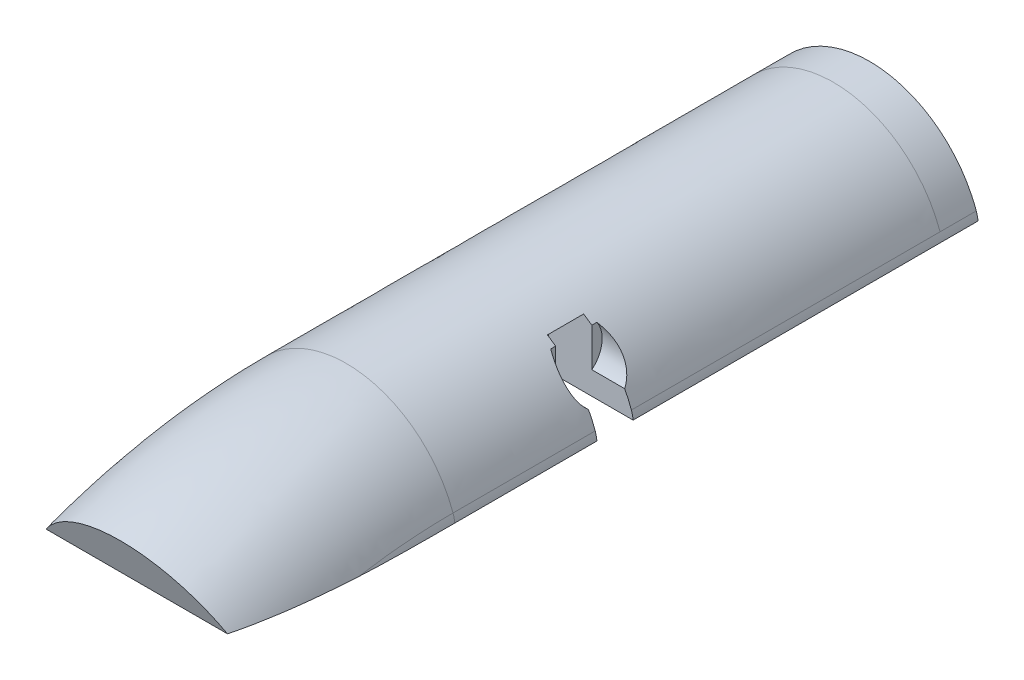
ISO-10303-21;
HEADER;
FILE_DESCRIPTION(('STEP AP214'),'2;1');
FILE_NAME('part.step','',(''),(''),'','','');
FILE_SCHEMA(('AUTOMOTIVE_DESIGN { 1 0 10303 214 1 1 1 1 }'));
ENDSEC;
DATA;
#1=APPLICATION_CONTEXT('core data for automotive mechanical design processes');
#2=APPLICATION_PROTOCOL_DEFINITION('international standard','automotive_design',2000,#1);
#3=PRODUCT_CONTEXT('',#1,'mechanical');
#4=PRODUCT('Part','Part','',(#3));
#5=PRODUCT_RELATED_PRODUCT_CATEGORY('part','',(#4));
#6=PRODUCT_DEFINITION_FORMATION('','',#4);
#7=PRODUCT_DEFINITION_CONTEXT('part definition',#1,'design');
#8=PRODUCT_DEFINITION('design','',#6,#7);
#9=PRODUCT_DEFINITION_SHAPE('','',#8);
#10=(LENGTH_UNIT() NAMED_UNIT(*) SI_UNIT(.MILLI.,.METRE.));
#11=(NAMED_UNIT(*) PLANE_ANGLE_UNIT() SI_UNIT($,.RADIAN.));
#12=(NAMED_UNIT(*) SI_UNIT($,.STERADIAN.) SOLID_ANGLE_UNIT());
#13=UNCERTAINTY_MEASURE_WITH_UNIT(LENGTH_MEASURE(1.E-05),#10,'distance_accuracy_value','');
#14=(GEOMETRIC_REPRESENTATION_CONTEXT(3) GLOBAL_UNCERTAINTY_ASSIGNED_CONTEXT((#13)) GLOBAL_UNIT_ASSIGNED_CONTEXT((#10,
#11,#12)) REPRESENTATION_CONTEXT('',''));
#15=CARTESIAN_POINT('',(0.,0.,0.));
#16=DIRECTION('',(0.,0.,1.));
#17=DIRECTION('',(1.,0.,0.));
#18=AXIS2_PLACEMENT_3D('',#15,#16,#17);
#19=CARTESIAN_POINT('',(15.0023362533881,5.73462773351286,47.108300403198));
#20=DIRECTION('',(0.,0.,1.));
#21=DIRECTION('',(1.,0.,0.));
#22=AXIS2_PLACEMENT_3D('',#19,#20,#21);
#23=CYLINDRICAL_SURFACE('',#22,6.);
#24=CARTESIAN_POINT('',(15.0023362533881,5.73462773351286,59.716600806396));
#25=DIRECTION('',(0.,0.,-1.));
#26=DIRECTION('',(-1.,0.,0.));
#27=AXIS2_PLACEMENT_3D('',#24,#25,#26);
#28=CIRCLE('',#27,6.);
#29=CARTESIAN_POINT('',(20.9813949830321,6.23548370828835,59.716600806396));
#30=VERTEX_POINT('',#29);
#31=CARTESIAN_POINT('',(20.6485556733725,7.76445685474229,59.716600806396));
#32=VERTEX_POINT('',#31);
#33=EDGE_CURVE('E621',#30,#32,#28,.F.);
#34=ORIENTED_EDGE('',*,*,#33,.F.);
#35=DIRECTION('',(0.,0.,1.));
#36=VECTOR('',#35,1.);
#37=CARTESIAN_POINT('',(20.9813949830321,6.23548370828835,47.108300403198));
#38=LINE('',#37,#36);
#39=CARTESIAN_POINT('',(20.9813949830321,6.23548370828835,-7.));
#40=VERTEX_POINT('',#39);
#41=EDGE_CURVE('E551',#30,#40,#38,.F.);
#42=ORIENTED_EDGE('',*,*,#41,.T.);
#43=CARTESIAN_POINT('',(15.0023362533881,5.73462773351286,-7.));
#44=DIRECTION('',(0.,0.,-1.));
#45=DIRECTION('',(-1.,0.,0.));
#46=AXIS2_PLACEMENT_3D('',#43,#44,#45);
#47=CIRCLE('',#46,6.);
#48=CARTESIAN_POINT('',(20.6485556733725,7.7644568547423,-7.));
#49=VERTEX_POINT('',#48);
#50=EDGE_CURVE('E581',#49,#40,#47,.T.);
#51=ORIENTED_EDGE('',*,*,#50,.F.);
#52=DIRECTION('',(0.,0.,1.));
#53=VECTOR('',#52,1.);
#54=CARTESIAN_POINT('',(20.6485556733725,7.7644568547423,-7.));
#55=LINE('',#54,#53);
#56=CARTESIAN_POINT('',(20.6485556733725,7.76445685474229,0.));
#57=VERTEX_POINT('',#56);
#58=EDGE_CURVE('E489',#49,#57,#55,.T.);
#59=ORIENTED_EDGE('',*,*,#58,.T.);
#60=DIRECTION('',(0.,0.,1.));
#61=VECTOR('',#60,1.);
#62=CARTESIAN_POINT('',(20.6485556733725,7.76445685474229,94.216600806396));
#63=LINE('',#62,#61);
#64=EDGE_CURVE('E534',#32,#57,#63,.F.);
#65=ORIENTED_EDGE('',*,*,#64,.F.);
#66=EDGE_LOOP('',(#34,#42,#51,#59,#65));
#67=FACE_BOUND('',#66,.T.);
#68=ADVANCED_FACE('F60',(#67),#23,.T.);
#69=CARTESIAN_POINT('',(13.,14.9354837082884,63.216600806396));
#70=DIRECTION('',(1.,0.,0.));
#71=DIRECTION('',(0.,0.,-1.));
#72=AXIS2_PLACEMENT_3D('',#69,#70,#71);
#73=CYLINDRICAL_SURFACE('',#72,5.5);
#74=CARTESIAN_POINT('',(13.,14.9354837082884,63.216600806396));
#75=DIRECTION('',(1.,0.,0.));
#76=DIRECTION('',(0.,0.,-1.));
#77=AXIS2_PLACEMENT_3D('',#74,#75,#76);
#78=CIRCLE('',#77,5.5);
#79=CARTESIAN_POINT('',(13.,10.6928430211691,59.716600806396));
#80=VERTEX_POINT('',#79);
#81=CARTESIAN_POINT('',(13.,18.1516084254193,58.7549260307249));
#82=VERTEX_POINT('',#81);
#83=EDGE_CURVE('E303',#80,#82,#78,.T.);
#84=ORIENTED_EDGE('',*,*,#83,.F.);
#85=DIRECTION('',(1.,0.,0.));
#86=VECTOR('',#85,1.);
#87=CARTESIAN_POINT('',(13.,10.6928430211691,59.716600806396));
#88=LINE('',#87,#86);
#89=CARTESIAN_POINT('',(19.3568666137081,10.6928430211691,59.716600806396));
#90=VERTEX_POINT('',#89);
#91=EDGE_CURVE('E293',#80,#90,#88,.T.);
#92=ORIENTED_EDGE('',*,*,#91,.T.);
#93=CARTESIAN_POINT('',(13.,18.1516084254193,67.6782755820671));
#94=CARTESIAN_POINT('',(13.1570417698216,18.0339764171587,67.7630391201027));
#95=CARTESIAN_POINT('',(13.3141097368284,17.9130296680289,67.8431818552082));
#96=CARTESIAN_POINT('',(13.6279573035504,17.6644318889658,67.9940574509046));
#97=CARTESIAN_POINT('',(13.7847359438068,17.5367696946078,68.0647739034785));
#98=CARTESIAN_POINT('',(14.0972204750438,17.274987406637,68.196377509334));
#99=CARTESIAN_POINT('',(14.2529256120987,17.1408632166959,68.25725831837));
#100=CARTESIAN_POINT('',(14.564111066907,16.8650631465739,68.3691820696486));
#101=CARTESIAN_POINT('',(14.719574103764,16.723325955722,68.4201223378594));
#102=CARTESIAN_POINT('',(15.0280388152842,16.4338569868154,68.5107355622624));
#103=CARTESIAN_POINT('',(15.1810417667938,16.2861284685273,68.5504145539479));
#104=CARTESIAN_POINT('',(15.4839870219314,15.9850256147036,68.6177348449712));
#105=CARTESIAN_POINT('',(15.633930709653,15.8316539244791,68.6453817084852));
#106=CARTESIAN_POINT('',(15.9374775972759,15.5119968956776,68.688795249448));
#107=CARTESIAN_POINT('',(16.090897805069,15.345447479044,68.7039103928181));
#108=CARTESIAN_POINT('',(16.3929296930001,15.0073500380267,68.718733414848));
#109=CARTESIAN_POINT('',(16.5415415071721,14.8358021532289,68.7184417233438));
#110=CARTESIAN_POINT('',(16.8325585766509,14.4893654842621,68.701210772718));
#111=CARTESIAN_POINT('',(16.9749845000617,14.3144911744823,68.6843322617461));
#112=CARTESIAN_POINT('',(17.2532623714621,13.9621538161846,68.632716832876));
#113=CARTESIAN_POINT('',(17.3891155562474,13.7846912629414,68.5979832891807));
#114=CARTESIAN_POINT('',(17.6286584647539,13.4620597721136,68.5176643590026));
#115=CARTESIAN_POINT('',(17.7336255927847,13.3170329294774,68.4753055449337));
#116=CARTESIAN_POINT('',(17.9380123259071,13.0275610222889,68.3773341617));
#117=CARTESIAN_POINT('',(18.0374330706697,12.883115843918,68.3217243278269));
#118=CARTESIAN_POINT('',(18.2302480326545,12.5960422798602,68.1967145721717));
#119=CARTESIAN_POINT('',(18.3236392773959,12.4534148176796,68.1273079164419));
#120=CARTESIAN_POINT('',(18.5038178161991,12.1715643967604,67.9743789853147));
#121=CARTESIAN_POINT('',(18.5906050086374,12.0323414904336,67.8908564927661));
#122=CARTESIAN_POINT('',(18.7577454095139,11.7579023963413,67.7088495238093));
#123=CARTESIAN_POINT('',(18.8380420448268,11.6227268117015,67.6102514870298));
#124=CARTESIAN_POINT('',(18.9909866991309,11.3594042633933,67.398726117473));
#125=CARTESIAN_POINT('',(19.063634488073,11.2312575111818,67.2857983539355));
#126=CARTESIAN_POINT('',(19.200872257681,10.984006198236,67.0461500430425));
#127=CARTESIAN_POINT('',(19.2654672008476,10.8648960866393,66.9194380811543));
#128=CARTESIAN_POINT('',(19.3863728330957,10.6375711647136,66.652965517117));
#129=CARTESIAN_POINT('',(19.4426849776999,10.5293544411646,66.513207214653));
#130=CARTESIAN_POINT('',(19.5396076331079,10.3398235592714,66.2420505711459));
#131=CARTESIAN_POINT('',(19.5813126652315,10.2568608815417,66.1121912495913));
#132=CARTESIAN_POINT('',(19.6583973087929,10.1014538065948,65.8445452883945));
#133=CARTESIAN_POINT('',(19.6937775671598,10.0290083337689,65.7067594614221));
#134=CARTESIAN_POINT('',(19.758177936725,9.89563007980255,65.4243714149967));
#135=CARTESIAN_POINT('',(19.7872006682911,9.83469255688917,65.2797720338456));
#136=CARTESIAN_POINT('',(19.8389098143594,9.72512008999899,64.9848897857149));
#137=CARTESIAN_POINT('',(19.8615965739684,9.67648447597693,64.8346072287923));
#138=CARTESIAN_POINT('',(19.8989533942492,9.5958519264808,64.542946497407));
#139=CARTESIAN_POINT('',(19.9141496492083,9.56277462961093,64.401933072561));
#140=CARTESIAN_POINT('',(19.9393008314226,9.50779803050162,64.1172870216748));
#141=CARTESIAN_POINT('',(19.9492560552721,9.48589809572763,63.9736545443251));
#142=CARTESIAN_POINT('',(19.9639406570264,9.45352898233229,63.6848738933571));
#143=CARTESIAN_POINT('',(19.9686711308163,9.44305740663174,63.5397260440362));
#144=CARTESIAN_POINT('',(19.9729189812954,9.43365620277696,63.248979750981));
#145=CARTESIAN_POINT('',(19.9724363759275,9.43472653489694,63.1033813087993));
#146=CARTESIAN_POINT('',(19.9663460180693,9.44819985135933,62.8170126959));
#147=CARTESIAN_POINT('',(19.9608857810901,9.46027664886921,62.6762238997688));
#148=CARTESIAN_POINT('',(19.9450343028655,9.49518200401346,62.3962174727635));
#149=CARTESIAN_POINT('',(19.9346414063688,9.51801417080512,62.2570003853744));
#150=CARTESIAN_POINT('',(19.9089137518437,9.57417332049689,61.9812289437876));
#151=CARTESIAN_POINT('',(19.8935811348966,9.60749575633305,61.8446734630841));
#152=CARTESIAN_POINT('',(19.8579481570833,9.68429418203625,61.5750577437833));
#153=CARTESIAN_POINT('',(19.8376459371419,9.72777397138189,61.4419988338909));
#154=CARTESIAN_POINT('',(19.7920101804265,9.82452360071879,61.180028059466));
#155=CARTESIAN_POINT('',(19.7666652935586,9.87781550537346,61.051126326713));
#156=CARTESIAN_POINT('',(19.7109566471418,9.99357711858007,60.7985718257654));
#157=CARTESIAN_POINT('',(19.6805907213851,10.0560507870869,60.6749213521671));
#158=CARTESIAN_POINT('',(19.6148599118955,10.1894951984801,60.4336899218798));
#159=CARTESIAN_POINT('',(19.5794951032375,10.260465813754,60.3161088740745));
#160=CARTESIAN_POINT('',(19.5038157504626,10.4101354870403,60.0877259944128));
#161=CARTESIAN_POINT('',(19.4635030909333,10.4888316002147,59.9769216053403));
#162=CARTESIAN_POINT('',(19.3765645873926,10.6558946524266,59.7590615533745));
#163=CARTESIAN_POINT('',(19.3297741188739,10.7444952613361,59.6522508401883));
#164=CARTESIAN_POINT('',(19.2310828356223,10.9281625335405,59.4469396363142));
#165=CARTESIAN_POINT('',(19.1791834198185,11.0232274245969,59.3484368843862));
#166=CARTESIAN_POINT('',(19.0703803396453,11.2189363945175,59.1600340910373));
#167=CARTESIAN_POINT('',(19.0134746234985,11.3195827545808,59.0701376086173));
#168=CARTESIAN_POINT('',(18.8948677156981,11.525442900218,58.8992503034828));
#169=CARTESIAN_POINT('',(18.8331676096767,11.6306556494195,58.8182574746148));
#170=CARTESIAN_POINT('',(18.7000734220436,11.8532629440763,58.6591797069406));
#171=CARTESIAN_POINT('',(18.6282986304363,11.9709609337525,58.5818379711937));
#172=CARTESIAN_POINT('',(18.4796812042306,12.2095180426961,58.437632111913));
#173=CARTESIAN_POINT('',(18.4028384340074,12.3303772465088,58.3707682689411));
#174=CARTESIAN_POINT('',(18.2443825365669,12.574264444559,58.2473628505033));
#175=CARTESIAN_POINT('',(18.1627680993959,12.6972930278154,58.1908241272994));
#176=CARTESIAN_POINT('',(17.9951186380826,12.9445668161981,58.087839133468));
#177=CARTESIAN_POINT('',(17.9090827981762,13.0688122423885,58.0413947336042));
#178=CARTESIAN_POINT('',(17.6978063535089,13.3673128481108,57.9417069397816));
#179=CARTESIAN_POINT('',(17.5706101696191,13.5417583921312,57.8931345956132));
#180=CARTESIAN_POINT('',(17.3091753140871,13.8894680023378,57.8140396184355));
#181=CARTESIAN_POINT('',(17.174934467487,14.0627316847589,57.7835225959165));
#182=CARTESIAN_POINT('',(16.9000933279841,14.4068155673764,57.7393159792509));
#183=CARTESIAN_POINT('',(16.7594821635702,14.5776308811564,57.725656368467));
#184=CARTESIAN_POINT('',(16.4729639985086,14.9153220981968,57.7140423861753));
#185=CARTESIAN_POINT('',(16.3270557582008,15.0821970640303,57.7160917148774));
#186=CARTESIAN_POINT('',(15.9851579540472,15.461674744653,57.73759399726));
#187=CARTESIAN_POINT('',(15.7875694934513,15.6725531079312,57.762206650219));
#188=CARTESIAN_POINT('',(15.3863230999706,16.0845437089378,57.8339051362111));
#189=CARTESIAN_POINT('',(15.1826626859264,16.285651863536,57.8810002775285));
#190=CARTESIAN_POINT('',(14.7709227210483,16.6770039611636,57.9956174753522));
#191=CARTESIAN_POINT('',(14.5628449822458,16.8672522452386,58.0631313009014));
#192=CARTESIAN_POINT('',(14.1436974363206,17.2362848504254,58.2169745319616));
#193=CARTESIAN_POINT('',(13.9326290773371,17.4150745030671,58.3032951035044));
#194=CARTESIAN_POINT('',(13.6008143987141,17.6858325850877,58.4523520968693));
#195=CARTESIAN_POINT('',(13.4806006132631,17.7818227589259,58.509078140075));
#196=CARTESIAN_POINT('',(13.240254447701,17.9697138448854,58.6279465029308));
#197=CARTESIAN_POINT('',(13.1201227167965,18.061625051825,58.6900738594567));
#198=CARTESIAN_POINT('',(13.,18.1516084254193,58.7549260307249));
#199=B_SPLINE_CURVE_WITH_KNOTS('',3,(#93,#94,#95,#96,#97,#98,#99,#100,#101,#102,#103,#104,#105,
#106,#107,#108,#109,#110,#111,#112,#113,#114,#115,#116,#117,#118,#119,#120,#121,#122,#123,#124,
#125,#126,#127,#128,#129,#130,#131,#132,#133,#134,#135,#136,#137,#138,#139,#140,#141,#142,#143,
#144,#145,#146,#147,#148,#149,#150,#151,#152,#153,#154,#155,#156,#157,#158,#159,#160,#161,#162,
#163,#164,#165,#166,#167,#168,#169,#170,#171,#172,#173,#174,#175,#176,#177,#178,#179,#180,#181,
#182,#183,#184,#185,#186,#187,#188,#189,#190,#191,#192,#193,#194,#195,#196,#197,#198),
.UNSPECIFIED.,.F.,.F.,(4,2,2,2,2,2,2,2,2,2,2,2,2,2,2,2,2,2,2,2,2,2,2,2,2,2,2,2,2,2,2,2,2,2,2,2,
2,2,2,2,2,2,2,2,2,2,2,2,2,2,2,2,4),(0.,0.641157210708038,1.28341628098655,1.92608798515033,
2.57508209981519,3.22372772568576,3.8720730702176,4.55232170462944,5.2325513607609,
5.91029896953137,6.58791854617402,7.13931602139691,7.69059977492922,8.24215326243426,
8.79371523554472,9.34965773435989,9.90561694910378,10.4612318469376,11.0167489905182,
11.4950349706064,11.973272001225,12.4513115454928,12.9293250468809,13.36569758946,
13.802045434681,14.2383017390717,14.6745565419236,15.0982886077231,15.5221629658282,
15.9458538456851,16.3697034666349,16.7945181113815,17.2195165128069,17.6445085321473,
18.0693391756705,18.5082113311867,18.9469636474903,19.3858966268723,19.8247305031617,
20.2984553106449,20.7721928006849,21.246060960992,21.7200168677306,22.3829221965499,
23.0460334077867,23.7103223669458,24.3747678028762,25.2436068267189,26.112805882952,
26.9816550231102,27.8500969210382,28.3418566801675,28.832295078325),.UNSPECIFIED.);
#200=EDGE_CURVE('E86',#90,#82,#199,.T.);
#201=ORIENTED_EDGE('',*,*,#200,.T.);
#202=EDGE_LOOP('',(#84,#92,#201));
#203=FACE_BOUND('',#202,.T.);
#204=ADVANCED_FACE('F271',(#203),#73,.F.);
#205=CARTESIAN_POINT('',(13.,14.9354837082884,63.216600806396));
#206=DIRECTION('',(1.,0.,0.));
#207=DIRECTION('',(0.,0.,-1.));
#208=AXIS2_PLACEMENT_3D('',#205,#206,#207);
#209=PLANE('',#208);
#210=DIRECTION('',(0.,1.,0.));
#211=VECTOR('',#210,1.);
#212=CARTESIAN_POINT('',(13.,14.9354837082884,59.716600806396));
#213=LINE('',#212,#211);
#214=CARTESIAN_POINT('',(13.,18.1516084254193,59.716600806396));
#215=VERTEX_POINT('',#214);
#216=EDGE_CURVE('E71',#80,#215,#213,.T.);
#217=ORIENTED_EDGE('',*,*,#216,.F.);
#218=ORIENTED_EDGE('',*,*,#83,.T.);
#219=DIRECTION('',(0.,0.,1.));
#220=VECTOR('',#219,1.);
#221=CARTESIAN_POINT('',(13.,18.1516084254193,47.108300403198));
#222=LINE('',#221,#220);
#223=EDGE_CURVE('E299',#215,#82,#222,.F.);
#224=ORIENTED_EDGE('',*,*,#223,.F.);
#225=EDGE_LOOP('',(#217,#218,#224));
#226=FACE_BOUND('',#225,.T.);
#227=ADVANCED_FACE('F265',(#226),#209,.T.);
#228=CARTESIAN_POINT('',(0.,-22.5,0.));
#229=CARTESIAN_POINT('',(0.,-22.5,94.2166008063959));
#230=CARTESIAN_POINT('',(44.,-22.5,0.));
#231=CARTESIAN_POINT('',(44.,-22.5,94.216600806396));
#232=CARTESIAN_POINT('',(44.,22.5,0.));
#233=CARTESIAN_POINT('',(44.,22.5,94.216600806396));
#234=CARTESIAN_POINT('',(0.,22.5,0.));
#235=CARTESIAN_POINT('',(0.,22.5,94.2166008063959));
#236=CARTESIAN_POINT('',(-44.,22.5,0.));
#237=CARTESIAN_POINT('',(-44.,22.5,94.216600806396));
#238=CARTESIAN_POINT('',(-44.,-22.5,0.));
#239=CARTESIAN_POINT('',(-44.,-22.5,94.216600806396));
#240=CARTESIAN_POINT('',(0.,-22.5,0.));
#241=CARTESIAN_POINT('',(0.,-22.5,94.2166008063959));
#242=(BOUNDED_SURFACE() B_SPLINE_SURFACE(3,1,((#228,#229),(#230,#231),(#232,#233),(#234,#235),
(#236,#237),(#238,#239),(#240,#241)),.UNSPECIFIED.,.T.,.F.,.F.) B_SPLINE_SURFACE_WITH_KNOTS((4,
3,4),(2,2),(0.,0.5,1.),(0.,1.),
.UNSPECIFIED.) GEOMETRIC_REPRESENTATION_ITEM() RATIONAL_B_SPLINE_SURFACE(((1.,1.),
(0.333333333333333,0.333333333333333),(0.333333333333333,0.333333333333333),(1.,1.),
(0.333333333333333,0.333333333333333),(0.333333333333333,0.333333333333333),(1.,1.))) REPRESENTATION_ITEM('') SURFACE());
#243=CARTESIAN_POINT('',(20.6485556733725,7.76445685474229,59.716600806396));
#244=CARTESIAN_POINT('',(20.5399845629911,8.06645781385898,59.716600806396));
#245=CARTESIAN_POINT('',(20.4250600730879,8.36613232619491,59.716600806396));
#246=CARTESIAN_POINT('',(20.1826574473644,8.9603672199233,59.716600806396));
#247=CARTESIAN_POINT('',(20.0551790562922,9.2549274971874,59.716600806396));
#248=CARTESIAN_POINT('',(19.6542031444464,10.1301102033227,59.716600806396));
#249=CARTESIAN_POINT('',(19.3621213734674,10.7023555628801,59.716600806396));
#250=CARTESIAN_POINT('',(18.7391552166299,11.8044541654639,59.716600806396));
#251=CARTESIAN_POINT('',(18.4095627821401,12.3350412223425,59.716600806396));
#252=CARTESIAN_POINT('',(17.7074206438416,13.3670435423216,59.716600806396));
#253=CARTESIAN_POINT('',(17.3348742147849,13.8684610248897,59.716600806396));
#254=CARTESIAN_POINT('',(16.6865277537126,14.6689344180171,59.716600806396));
#255=CARTESIAN_POINT('',(16.4223767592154,14.9775079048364,59.716600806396));
#256=CARTESIAN_POINT('',(15.8776142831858,15.5798061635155,59.716600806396));
#257=CARTESIAN_POINT('',(15.5970027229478,15.8735308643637,59.716600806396));
#258=CARTESIAN_POINT('',(15.0201203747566,16.4451651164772,59.716600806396));
#259=CARTESIAN_POINT('',(14.7238496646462,16.723074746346,59.716600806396));
#260=CARTESIAN_POINT('',(14.1080889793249,17.2696388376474,59.716600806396));
#261=CARTESIAN_POINT('',(13.7881837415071,17.5378258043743,59.716600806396));
#262=CARTESIAN_POINT('',(13.1336567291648,18.0556474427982,59.716600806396));
#263=CARTESIAN_POINT('',(12.7990338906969,18.3052807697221,59.716600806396));
#264=CARTESIAN_POINT('',(12.1160676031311,18.7851574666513,59.716600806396));
#265=CARTESIAN_POINT('',(11.7677215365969,19.0153971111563,59.716600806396));
#266=CARTESIAN_POINT('',(11.4130654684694,19.2354837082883,59.7166008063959));
#267=B_SPLINE_CURVE_WITH_KNOTS('',3,(#243,#244,#245,#246,#247,#248,#249,#250,#251,#252,#253,
#254,#255,#256,#257,#258,#259,#260,#261,#262,#263,#264,#265,#266),.UNSPECIFIED.,.F.,.F.,(4,2,2,
2,2,2,2,2,2,2,2,4),(0.,0.962620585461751,1.92526074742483,3.85015639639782,5.72197739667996,
7.59365578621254,8.81169450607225,10.0297390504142,11.2477775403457,12.4994513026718,
13.7512156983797,15.0032200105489),.UNSPECIFIED.);
#268=EDGE_CURVE('E301',#32,#90,#267,.T.);
#269=CARTESIAN_POINT('',(0.,0.,0.));
#270=DIRECTION('',(0.,0.,1.));
#271=DIRECTION('',(0.,-1.,0.));
#272=AXIS2_PLACEMENT_3D('',#269,#270,#271);
#273=ELLIPSE('',#272,22.5,22.);
#274=CARTESIAN_POINT('',(-20.6485556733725,7.76445685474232,0.));
#275=VERTEX_POINT('',#274);
#276=EDGE_CURVE('E472',#57,#275,#273,.T.);
#277=DIRECTION('',(0.,0.,1.));
#278=VECTOR('',#277,1.);
#279=CARTESIAN_POINT('',(-20.6485556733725,7.76445685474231,0.));
#280=LINE('',#279,#278);
#281=CARTESIAN_POINT('',(-20.6485556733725,7.76445685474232,94.2166008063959));
#282=VERTEX_POINT('',#281);
#283=EDGE_CURVE('E364',#275,#282,#280,.T.);
#284=CARTESIAN_POINT('',(0.,0.,94.2166008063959));
#285=DIRECTION('',(0.,0.,1.));
#286=DIRECTION('',(0.,-1.,0.));
#287=AXIS2_PLACEMENT_3D('',#284,#285,#286);
#288=ELLIPSE('',#287,22.5,22.);
#289=CARTESIAN_POINT('',(20.6485556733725,7.76445685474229,94.2166008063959));
#290=VERTEX_POINT('',#289);
#291=EDGE_CURVE('E468',#290,#282,#288,.T.);
#292=CARTESIAN_POINT('',(20.6485556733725,7.76445685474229,66.7166008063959));
#293=VERTEX_POINT('',#292);
#294=EDGE_CURVE('E439',#290,#293,#63,.F.);
#295=CARTESIAN_POINT('',(11.4130654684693,19.2354837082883,66.716600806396));
#296=CARTESIAN_POINT('',(11.7727426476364,19.0122819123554,66.7166008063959));
#297=CARTESIAN_POINT('',(12.1259292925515,18.7786370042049,66.7166008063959));
#298=CARTESIAN_POINT('',(12.8181740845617,18.2914064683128,66.7166008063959));
#299=CARTESIAN_POINT('',(13.1572348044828,18.0378244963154,66.7166008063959));
#300=CARTESIAN_POINT('',(13.8201904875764,17.511600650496,66.7166008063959));
#301=CARTESIAN_POINT('',(14.1440864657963,17.2389600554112,66.7166008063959));
#302=CARTESIAN_POINT('',(14.7671278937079,16.6832526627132,66.7166008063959));
#303=CARTESIAN_POINT('',(15.0667071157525,16.4006718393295,66.7166008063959));
#304=CARTESIAN_POINT('',(15.649720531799,15.8193128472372,66.7166008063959));
#305=CARTESIAN_POINT('',(15.9331547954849,15.5205347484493,66.7166008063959));
#306=CARTESIAN_POINT('',(16.4830463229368,14.9077914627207,66.7166008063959));
#307=CARTESIAN_POINT('',(16.7495039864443,14.5938266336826,66.7166008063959));
#308=CARTESIAN_POINT('',(17.3923973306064,13.7925384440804,66.7166008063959));
#309=CARTESIAN_POINT('',(17.7579205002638,13.2963880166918,66.7166008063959));
#310=CARTESIAN_POINT('',(18.4470681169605,12.2758598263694,66.7166008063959));
#311=CARTESIAN_POINT('',(18.7706904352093,11.7514806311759,66.7166008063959));
#312=CARTESIAN_POINT('',(19.3825950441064,10.662984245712,66.7166008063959));
#313=CARTESIAN_POINT('',(19.6696358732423,10.0981658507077,66.7166008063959));
#314=CARTESIAN_POINT('',(20.0640583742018,9.23462052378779,66.7166008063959));
#315=CARTESIAN_POINT('',(20.1895209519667,8.94402036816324,66.7166008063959));
#316=CARTESIAN_POINT('',(20.428233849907,8.35785306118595,66.7166008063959));
#317=CARTESIAN_POINT('',(20.5414844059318,8.06228600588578,66.7166008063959));
#318=CARTESIAN_POINT('',(20.6485556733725,7.76445685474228,66.7166008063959));
#319=B_SPLINE_CURVE_WITH_KNOTS('',3,(#295,#296,#297,#298,#299,#300,#301,#302,#303,#304,#305,
#306,#307,#308,#309,#310,#311,#312,#313,#314,#315,#316,#317,#318),.UNSPECIFIED.,.F.,.F.,(4,2,2,
2,2,2,2,2,2,2,2,4),(0.,1.26972322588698,2.53921417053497,3.8086200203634,5.04346431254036,
6.27830327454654,7.513113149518,9.35965803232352,11.2062966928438,13.1045797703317,
14.0539252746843,15.003252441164),.UNSPECIFIED.);
#320=CARTESIAN_POINT('',(19.3568666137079,10.6928430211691,66.7166008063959));
#321=VERTEX_POINT('',#320);
#322=EDGE_CURVE('E237',#321,#293,#319,.T.);
#323=CARTESIAN_POINT('',(13.,18.1516084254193,67.678275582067));
#324=VERTEX_POINT('',#323);
#325=EDGE_CURVE('E275',#324,#321,#199,.T.);
#326=CARTESIAN_POINT('',(13.,18.1516084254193,66.7166008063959));
#327=VERTEX_POINT('',#326);
#328=EDGE_CURVE('E285',#324,#327,#222,.F.);
#329=CARTESIAN_POINT('',(11.4130654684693,19.2354837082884,66.7166008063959));
#330=VERTEX_POINT('',#329);
#331=EDGE_CURVE('E78',#330,#327,#319,.T.);
#332=DIRECTION('',(0.,0.,1.));
#333=VECTOR('',#332,1.);
#334=CARTESIAN_POINT('',(11.4130654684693,19.2354837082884,47.108300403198));
#335=LINE('',#334,#333);
#336=CARTESIAN_POINT('',(11.4130654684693,19.2354837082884,59.716600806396));
#337=VERTEX_POINT('',#336);
#338=EDGE_CURVE('E12',#330,#337,#335,.F.);
#339=EDGE_CURVE('E292',#215,#337,#267,.T.);
#340=ORIENTED_EDGE('',*,*,#268,.F.);
#341=ORIENTED_EDGE('',*,*,#64,.T.);
#342=ORIENTED_EDGE('',*,*,#276,.T.);
#343=ORIENTED_EDGE('',*,*,#283,.T.);
#344=ORIENTED_EDGE('',*,*,#291,.F.);
#345=ORIENTED_EDGE('',*,*,#294,.T.);
#346=ORIENTED_EDGE('',*,*,#322,.F.);
#347=ORIENTED_EDGE('',*,*,#325,.F.);
#348=ORIENTED_EDGE('',*,*,#328,.T.);
#349=ORIENTED_EDGE('',*,*,#331,.F.);
#350=ORIENTED_EDGE('',*,*,#338,.T.);
#351=ORIENTED_EDGE('',*,*,#339,.F.);
#352=ORIENTED_EDGE('',*,*,#223,.T.);
#353=ORIENTED_EDGE('',*,*,#200,.F.);
#354=EDGE_LOOP('',(#340,#341,#342,#343,#344,#345,#346,#347,#348,#349,#350,#351,#352,#353));
#355=FACE_BOUND('',#354,.T.);
#356=ADVANCED_FACE('F248',(#355),#242,.T.);
#357=CARTESIAN_POINT('',(0.,0.,-7.));
#358=DIRECTION('',(0.,0.,-1.));
#359=DIRECTION('',(0.,-1.,0.));
#360=AXIS2_PLACEMENT_3D('',#357,#358,#359);
#361=ELLIPSE('',#360,22.5,22.);
#362=DIRECTION('',(0.,0.,1.));
#363=VECTOR('',#362,1.);
#364=SURFACE_OF_LINEAR_EXTRUSION('',#361,#363);
#365=ORIENTED_EDGE('',*,*,#276,.F.);
#366=ORIENTED_EDGE('',*,*,#58,.F.);
#367=CARTESIAN_POINT('',(-20.6485556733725,7.76445685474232,-7.));
#368=VERTEX_POINT('',#367);
#369=EDGE_CURVE('E493',#368,#49,#361,.T.);
#370=ORIENTED_EDGE('',*,*,#369,.F.);
#371=DIRECTION('',(0.,0.,1.));
#372=VECTOR('',#371,1.);
#373=CARTESIAN_POINT('',(-20.6485556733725,7.76445685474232,-7.));
#374=LINE('',#373,#372);
#375=EDGE_CURVE('E485',#368,#275,#374,.T.);
#376=ORIENTED_EDGE('',*,*,#375,.T.);
#377=EDGE_LOOP('',(#365,#366,#370,#376));
#378=FACE_BOUND('',#377,.T.);
#379=ADVANCED_FACE('F447',(#378),#364,.F.);
#380=CARTESIAN_POINT('',(0.,-6.4662930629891,130.));
#381=DIRECTION('',(0.,-0.34998433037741,0.936755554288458));
#382=DIRECTION('',(1.,0.,0.));
#383=AXIS2_PLACEMENT_3D('',#380,#381,#382);
#384=PLANE('',#383);
#385=CARTESIAN_POINT('',(0.,-6.4662930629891,130.));
#386=DIRECTION('',(0.,-0.34998433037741,0.936755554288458));
#387=DIRECTION('',(0.,-0.936755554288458,-0.34998433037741));
#388=AXIS2_PLACEMENT_3D('',#385,#386,#387);
#389=ELLIPSE('',#388,22.5,22.);
#390=CARTESIAN_POINT('',(17.5564593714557,6.23548369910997,134.745552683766));
#391=VERTEX_POINT('',#390);
#392=CARTESIAN_POINT('',(-17.5564464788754,6.23548369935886,134.745552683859));
#393=VERTEX_POINT('',#392);
#394=EDGE_CURVE('E464',#391,#393,#389,.T.);
#395=ORIENTED_EDGE('',*,*,#394,.T.);
#396=DIRECTION('',(1.,0.,0.));
#397=VECTOR('',#396,1.);
#398=CARTESIAN_POINT('',(0.,6.23548370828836,134.745552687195));
#399=LINE('',#398,#397);
#400=EDGE_CURVE('E571',#393,#391,#399,.T.);
#401=ORIENTED_EDGE('',*,*,#400,.T.);
#402=EDGE_LOOP('',(#395,#401));
#403=FACE_BOUND('',#402,.T.);
#404=ADVANCED_FACE('F444',(#403),#384,.T.);
#405=CARTESIAN_POINT('',(-21.0023362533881,5.73462773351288,82.4161308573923));
#406=CARTESIAN_POINT('',(-21.0023362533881,6.78037264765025,82.4161308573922));
#407=CARTESIAN_POINT('',(-20.6485556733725,7.76445685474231,82.4161308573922));
#408=CARTESIAN_POINT('',(-21.0023362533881,5.7346277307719,86.3496208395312));
#409=CARTESIAN_POINT('',(-21.0023362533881,6.78037264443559,86.3496208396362));
#410=CARTESIAN_POINT('',(-20.6485556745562,7.76445685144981,86.3496208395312));
#411=CARTESIAN_POINT('',(-21.0023362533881,5.73462772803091,90.2831108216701));
#412=CARTESIAN_POINT('',(-21.0023362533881,6.78037264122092,90.2831108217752));
#413=CARTESIAN_POINT('',(-20.6485556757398,7.76445684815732,90.2831108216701));
#414=CARTESIAN_POINT('',(-21.0023362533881,5.73462772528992,94.2166008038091));
#415=CARTESIAN_POINT('',(-21.0023362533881,6.78037263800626,94.2166008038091));
#416=CARTESIAN_POINT('',(-20.6485556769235,7.76445684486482,94.2166008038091));
#417=CARTESIAN_POINT('',(-21.0023362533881,5.73465565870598,95.4501868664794));
#418=CARTESIAN_POINT('',(-21.0023362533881,6.78040084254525,95.4621339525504));
#419=CARTESIAN_POINT('',(-20.6485556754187,7.76448530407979,95.4733765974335));
#420=CARTESIAN_POINT('',(-21.0023362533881,5.71349886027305,96.6839080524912));
#421=CARTESIAN_POINT('',(-21.0023362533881,6.75903914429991,96.7078035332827));
#422=CARTESIAN_POINT('',(-20.6485556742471,7.7429307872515,96.7302900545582));
#423=CARTESIAN_POINT('',(-21.0023362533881,5.58208373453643,100.515141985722));
#424=CARTESIAN_POINT('',(-21.0023362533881,6.62635128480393,100.576142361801));
#425=CARTESIAN_POINT('',(-20.6485556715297,7.60904523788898,100.633545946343));
#426=CARTESIAN_POINT('',(-21.0023362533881,5.39911493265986,103.110455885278));
#427=CARTESIAN_POINT('',(-21.0023362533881,6.4416104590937,103.196591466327));
#428=CARTESIAN_POINT('',(-20.6485556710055,7.42263687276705,103.277648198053));
#429=CARTESIAN_POINT('',(-21.0023362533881,4.84621118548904,108.282041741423));
#430=CARTESIAN_POINT('',(-21.0023362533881,5.8833519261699,108.418263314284));
#431=CARTESIAN_POINT('',(-20.6485556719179,6.85933929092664,108.546452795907));
#432=CARTESIAN_POINT('',(-21.0023362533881,4.476195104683,110.858304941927));
#433=CARTESIAN_POINT('',(-21.0023362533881,5.50975229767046,111.019477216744));
#434=CARTESIAN_POINT('',(-20.6485556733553,6.48236741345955,111.171146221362));
#435=CARTESIAN_POINT('',(-21.0023362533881,3.55226390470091,115.97118816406));
#436=CARTESIAN_POINT('',(-21.0023362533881,4.57687297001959,116.181877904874));
#437=CARTESIAN_POINT('',(-20.6485556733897,5.54106757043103,116.380144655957));
#438=CARTESIAN_POINT('',(-21.0023362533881,2.99879678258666,118.507889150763));
#439=CARTESIAN_POINT('',(-21.0023362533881,4.01804560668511,118.743146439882));
#440=CARTESIAN_POINT('',(-20.6485556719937,4.97719602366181,118.964532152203));
#441=CARTESIAN_POINT('',(-21.0023362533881,1.71077343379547,123.533912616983));
#442=CARTESIAN_POINT('',(-21.0023362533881,2.71754795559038,123.817846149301));
#443=CARTESIAN_POINT('',(-20.6485556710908,3.66495959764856,124.085037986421));
#444=CARTESIAN_POINT('',(-21.0023362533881,0.976295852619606,126.023255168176));
#445=CARTESIAN_POINT('',(-21.0023362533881,1.9759570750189,126.331297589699));
#446=CARTESIAN_POINT('',(-20.6485556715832,2.91667484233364,126.621176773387));
#447=CARTESIAN_POINT('',(-21.0023362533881,-0.242201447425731,129.664591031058));
#448=CARTESIAN_POINT('',(-21.0023362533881,0.745658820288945,130.007899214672));
#449=CARTESIAN_POINT('',(-20.6485556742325,1.67527145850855,130.330964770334));
#450=CARTESIAN_POINT('',(-21.0023362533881,-0.658172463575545,130.839657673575));
#451=CARTESIAN_POINT('',(-21.0023362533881,0.325659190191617,131.19434619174));
#452=CARTESIAN_POINT('',(-20.6485556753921,1.25148075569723,131.528121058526));
#453=CARTESIAN_POINT('',(-21.0023362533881,-1.09434868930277,132.007029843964));
#454=CARTESIAN_POINT('',(-21.0023362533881,-0.11474133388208,132.37302417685));
#455=CARTESIAN_POINT('',(-20.6485556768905,0.807105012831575,132.717438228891));
#456=CARTESIAN_POINT('',(-21.0023362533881,-2.4686169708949,135.685347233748));
#457=CARTESIAN_POINT('',(-21.0023362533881,-1.48900961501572,136.051341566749));
#458=CARTESIAN_POINT('',(-20.6485556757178,-0.567163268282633,136.395755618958));
#459=CARTESIAN_POINT('',(-21.0023362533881,-3.84288525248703,139.363664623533));
#460=CARTESIAN_POINT('',(-21.0023362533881,-2.86327789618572,139.729658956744));
#461=CARTESIAN_POINT('',(-20.6485556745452,-1.94143154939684,140.074073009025));
#462=CARTESIAN_POINT('',(-21.0023362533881,-5.21715353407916,143.041982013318));
#463=CARTESIAN_POINT('',(-21.0023362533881,-4.23754617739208,143.407976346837));
#464=CARTESIAN_POINT('',(-20.6485556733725,-3.31569983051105,143.752390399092));
#465=(BOUNDED_SURFACE() B_SPLINE_SURFACE(3,2,((#405,#406,#407),(#408,#409,#410),(#411,#412,
#413),(#414,#415,#416),(#417,#418,#419),(#420,#421,#422),(#423,#424,#425),(#426,#427,#428),
(#429,#430,#431),(#432,#433,#434),(#435,#436,#437),(#438,#439,#440),(#441,#442,#443),(#444,#445,
#446),(#447,#448,#449),(#450,#451,#452),(#453,#454,#455),(#456,#457,#458),(#459,#460,#461),
(#462,#463,#464)),.UNSPECIFIED.,.F.,.F.,.F.) B_SPLINE_SURFACE_WITH_KNOTS((4,3,2,2,2,2,2,3,4),(3,
3),(0.,11.8004699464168,15.5014026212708,23.2994131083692,31.1008090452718,38.8832922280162,
46.6624000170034,50.4011632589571,62.1811330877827),(0.,1.),
.UNSPECIFIED.) GEOMETRIC_REPRESENTATION_ITEM() RATIONAL_B_SPLINE_SURFACE(((1.,0.98514886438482,
1.),(1.,0.985148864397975,1.),(1.,0.985148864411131,1.),(1.,0.985148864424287,1.),(1.,
0.985148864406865,1.),(1.,0.985148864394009,1.),(1.,0.985148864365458,1.),(1.,0.985148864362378,
1.),(1.,0.985148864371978,1.),(1.,0.985148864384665,1.),(1.,0.985148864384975,1.),(1.,
0.985148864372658,1.),(1.,0.985148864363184,1.),(1.,0.985148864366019,1.),(1.,0.985148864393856,
1.),(1.,0.985148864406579,1.),(1.,0.985148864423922,1.),(1.,0.985148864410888,1.),(1.,
0.985148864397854,1.),(1.,0.98514886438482,1.))) REPRESENTATION_ITEM('') SURFACE());
#466=CARTESIAN_POINT('',(-15.0023362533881,5.73462773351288,94.216600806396));
#467=DIRECTION('',(0.,0.,1.));
#468=DIRECTION('',(0.,-1.,0.));
#469=AXIS2_PLACEMENT_3D('',#466,#467,#468);
#470=CIRCLE('',#469,6.);
#471=CARTESIAN_POINT('',(-20.9813949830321,6.23548370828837,94.2166008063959));
#472=VERTEX_POINT('',#471);
#473=EDGE_CURVE('E477',#282,#472,#470,.T.);
#474=ORIENTED_EDGE('',*,*,#473,.T.);
#475=CARTESIAN_POINT('',(-20.9813949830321,6.23548370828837,94.2166008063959));
#476=CARTESIAN_POINT('',(-20.9813831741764,6.23548370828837,94.7166909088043));
#477=CARTESIAN_POINT('',(-20.9811062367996,6.23548370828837,95.2167810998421));
#478=CARTESIAN_POINT('',(-20.9799302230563,6.23548370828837,96.2169615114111));
#479=CARTESIAN_POINT('',(-20.9790311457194,6.23548370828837,96.7170517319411));
#480=CARTESIAN_POINT('',(-20.9765189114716,6.23548370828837,97.7172536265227));
#481=CARTESIAN_POINT('',(-20.9749057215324,6.23548370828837,98.2173653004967));
#482=CARTESIAN_POINT('',(-20.9707767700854,6.23548370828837,99.2175846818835));
#483=CARTESIAN_POINT('',(-20.9682610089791,6.23548370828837,99.7176923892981));
#484=CARTESIAN_POINT('',(-20.9590053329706,6.23548370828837,101.217675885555));
#485=CARTESIAN_POINT('',(-20.9505564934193,6.23548370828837,102.217542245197));
#486=CARTESIAN_POINT('',(-20.9262257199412,6.23548370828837,104.217180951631));
#487=CARTESIAN_POINT('',(-20.9103439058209,6.23548370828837,105.216953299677));
#488=CARTESIAN_POINT('',(-20.8772605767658,6.23548370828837,106.739952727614));
#489=CARTESIAN_POINT('',(-20.8642933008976,6.23548370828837,107.263270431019));
#490=CARTESIAN_POINT('',(-20.8343836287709,6.23548370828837,108.309787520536));
#491=CARTESIAN_POINT('',(-20.8174412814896,6.23548370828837,108.832986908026));
#492=CARTESIAN_POINT('',(-20.7787119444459,6.23548370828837,109.879295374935));
#493=CARTESIAN_POINT('',(-20.7569241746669,6.23548370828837,110.402404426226));
#494=CARTESIAN_POINT('',(-20.7074388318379,6.23548370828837,111.448365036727));
#495=CARTESIAN_POINT('',(-20.6797409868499,6.23548370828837,111.971216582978));
#496=CARTESIAN_POINT('',(-20.6485556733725,6.23548370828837,112.49387386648));
#497=B_SPLINE_CURVE_WITH_KNOTS('',3,(#475,#476,#477,#478,#479,#480,#481,#482,#483,#484,#485,
#486,#487,#488,#489,#490,#491,#492,#493,#494,#495,#496),.UNSPECIFIED.,.F.,.F.,(4,2,2,2,2,2,2,2,
2,2,4),(0.,1.50027036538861,3.00054307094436,4.50088517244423,6.00122660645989,9.00091889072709,
12.0005628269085,13.5709858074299,15.1413894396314,16.71204605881,18.2827749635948),.UNSPECIFIED.);
#498=CARTESIAN_POINT('',(-20.6485556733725,6.23548370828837,112.49387386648));
#499=VERTEX_POINT('',#498);
#500=EDGE_CURVE('E543',#472,#499,#497,.T.);
#501=ORIENTED_EDGE('',*,*,#500,.T.);
#502=CARTESIAN_POINT('',(-20.6485556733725,7.76445685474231,82.4161308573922));
#503=CARTESIAN_POINT('',(-20.6485556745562,7.76445685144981,86.3496208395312));
#504=CARTESIAN_POINT('',(-20.6485556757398,7.76445684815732,90.2831108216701));
#505=CARTESIAN_POINT('',(-20.6485556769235,7.76445684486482,94.2166008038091));
#506=CARTESIAN_POINT('',(-20.6485556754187,7.76448530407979,95.4733765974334));
#507=CARTESIAN_POINT('',(-20.6485556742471,7.7429307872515,96.7302900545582));
#508=CARTESIAN_POINT('',(-20.6485556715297,7.60904523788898,100.633545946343));
#509=CARTESIAN_POINT('',(-20.6485556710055,7.42263687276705,103.277648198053));
#510=CARTESIAN_POINT('',(-20.6485556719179,6.85933929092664,108.546452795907));
#511=CARTESIAN_POINT('',(-20.6485556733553,6.48236741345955,111.171146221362));
#512=CARTESIAN_POINT('',(-20.6485556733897,5.54106757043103,116.380144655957));
#513=CARTESIAN_POINT('',(-20.6485556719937,4.97719602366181,118.964532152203));
#514=CARTESIAN_POINT('',(-20.6485556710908,3.66495959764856,124.085037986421));
#515=CARTESIAN_POINT('',(-20.6485556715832,2.91667484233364,126.621176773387));
#516=CARTESIAN_POINT('',(-20.6485556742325,1.67527145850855,130.330964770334));
#517=CARTESIAN_POINT('',(-20.6485556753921,1.25148075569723,131.528121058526));
#518=CARTESIAN_POINT('',(-20.6485556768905,0.807105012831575,132.717438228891));
#519=CARTESIAN_POINT('',(-20.6485556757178,-0.567163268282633,136.395755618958));
#520=CARTESIAN_POINT('',(-20.6485556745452,-1.94143154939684,140.074073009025));
#521=CARTESIAN_POINT('',(-20.6485556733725,-3.31569983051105,143.752390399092));
#522=B_SPLINE_CURVE_WITH_KNOTS('',3,(#502,#503,#504,#505,#506,#507,#508,#509,#510,#511,#512,
#513,#514,#515,#516,#517,#518,#519,#520,#521),.UNSPECIFIED.,.F.,.F.,(4,3,2,2,2,2,2,3,4),(0.,
11.8004699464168,15.5014026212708,23.2994131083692,31.1008090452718,38.8832922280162,
46.6624000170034,50.4011632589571,62.1811330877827),.UNSPECIFIED.);
#523=EDGE_CURVE('E438',#282,#499,#522,.T.);
#524=ORIENTED_EDGE('',*,*,#523,.F.);
#525=EDGE_LOOP('',(#474,#501,#524));
#526=FACE_BOUND('',#525,.T.);
#527=ADVANCED_FACE('F344',(#526),#465,.T.);
#528=CARTESIAN_POINT('',(-15.0023362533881,5.73462773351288,48.2032526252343));
#529=DIRECTION('',(0.,0.,-1.));
#530=DIRECTION('',(-1.,0.,0.));
#531=AXIS2_PLACEMENT_3D('',#528,#529,#530);
#532=CONICAL_SURFACE('',#531,6.,0.982793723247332);
#533=CARTESIAN_POINT('',(-15.0023362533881,5.73462773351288,48.2032526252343));
#534=DIRECTION('',(0.,0.,1.));
#535=DIRECTION('',(1.,0.,0.));
#536=AXIS2_PLACEMENT_3D('',#533,#534,#535);
#537=CIRCLE('',#536,6.);
#538=CARTESIAN_POINT('',(-20.9813949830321,6.23548370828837,48.2032526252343));
#539=VERTEX_POINT('',#538);
#540=CARTESIAN_POINT('',(-20.743993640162,7.4762851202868,48.2032526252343));
#541=VERTEX_POINT('',#540);
#542=EDGE_CURVE('E310',#539,#541,#537,.F.);
#543=ORIENTED_EDGE('',*,*,#542,.F.);
#544=CARTESIAN_POINT('',(-23.193025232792,6.23548370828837,46.7325938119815));
#545=CARTESIAN_POINT('',(-22.9349288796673,6.23548370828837,46.9043353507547));
#546=CARTESIAN_POINT('',(-22.6768202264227,6.23548370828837,47.0760584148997));
#547=CARTESIAN_POINT('',(-22.1605651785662,6.23548370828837,47.4194473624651));
#548=CARTESIAN_POINT('',(-21.9024187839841,6.23548370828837,47.5911132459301));
#549=CARTESIAN_POINT('',(-21.3860758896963,6.23548370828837,47.9343670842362));
#550=CARTESIAN_POINT('',(-21.1278793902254,6.23548370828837,48.1059550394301));
#551=CARTESIAN_POINT('',(-20.6114119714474,6.23548370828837,48.4490193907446));
#552=CARTESIAN_POINT('',(-20.3531410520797,6.23548370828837,48.6204957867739));
#553=CARTESIAN_POINT('',(-19.8364843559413,6.23548370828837,48.9632797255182));
#554=CARTESIAN_POINT('',(-19.578098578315,6.23548370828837,49.1345872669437));
#555=CARTESIAN_POINT('',(-19.06114653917,6.23548370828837,49.4769289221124));
#556=CARTESIAN_POINT('',(-18.8025802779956,6.23548370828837,49.6479630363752));
#557=CARTESIAN_POINT('',(-18.4144842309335,6.23548370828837,49.9041428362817));
#558=CARTESIAN_POINT('',(-18.2850772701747,6.23548370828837,49.9894745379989));
#559=CARTESIAN_POINT('',(-18.0261452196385,6.23548370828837,50.1599581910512));
#560=CARTESIAN_POINT('',(-17.8966201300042,6.23548370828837,50.2451101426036));
#561=CARTESIAN_POINT('',(-17.6374015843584,6.23548370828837,50.4151596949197));
#562=CARTESIAN_POINT('',(-17.5077081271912,6.23548370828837,50.5000572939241));
#563=CARTESIAN_POINT('',(-17.2480433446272,6.23548370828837,50.6694275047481));
#564=CARTESIAN_POINT('',(-17.1180720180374,6.23548370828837,50.7539001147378));
#565=CARTESIAN_POINT('',(-16.9879071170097,6.23548370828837,50.8380748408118));
#566=B_SPLINE_CURVE_WITH_KNOTS('',3,(#544,#545,#546,#547,#548,#549,#550,#551,#552,#553,#554,
#555,#556,#557,#558,#559,#560,#561,#562,#563,#564,#565),.UNSPECIFIED.,.F.,.F.,(4,2,2,2,2,2,2,2,
2,2,4),(0.,0.930042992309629,1.86008525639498,2.79012326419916,3.72016203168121,
4.65020784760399,5.58025189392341,6.04527752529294,6.51030259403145,6.97533087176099,
7.44036115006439),.UNSPECIFIED.);
#567=CARTESIAN_POINT('',(-19.5031922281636,6.23548370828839,49.1841606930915));
#568=VERTEX_POINT('',#567);
#569=EDGE_CURVE('E305',#539,#568,#566,.T.);
#570=ORIENTED_EDGE('',*,*,#569,.T.);
#571=CARTESIAN_POINT('',(-20.743993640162,7.4762851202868,48.2032526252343));
#572=CARTESIAN_POINT('',(-20.6798564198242,7.41214789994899,48.2565795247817));
#573=CARTESIAN_POINT('',(-20.6156262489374,7.34791772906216,48.3096830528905));
#574=CARTESIAN_POINT('',(-20.4869519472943,7.21924342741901,48.4153718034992));
#575=CARTESIAN_POINT('',(-20.4225078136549,7.15479929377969,48.4679570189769));
#576=CARTESIAN_POINT('',(-20.2288590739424,6.96115055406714,48.6247899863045));
#577=CARTESIAN_POINT('',(-20.0992943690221,6.8315858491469,48.7281515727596));
#578=CARTESIAN_POINT('',(-19.8388976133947,6.57118909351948,48.931723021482));
#579=CARTESIAN_POINT('',(-19.7080653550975,6.44035683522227,49.0319323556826));
#580=CARTESIAN_POINT('',(-19.5105672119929,6.24285869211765,49.1789661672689));
#581=CARTESIAN_POINT('',(-19.4445151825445,6.17680666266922,49.2274384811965));
#582=CARTESIAN_POINT('',(-19.3119312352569,6.04422271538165,49.3230646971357));
#583=CARTESIAN_POINT('',(-19.2453992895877,5.97769076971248,49.3702185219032));
#584=CARTESIAN_POINT('',(-19.1785960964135,5.91088757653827,49.4166008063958));
#585=B_SPLINE_CURVE_WITH_KNOTS('',3,(#571,#572,#573,#574,#575,#576,#577,#578,#579,#580,#581,
#582,#583,#584),.UNSPECIFIED.,.F.,.F.,(4,2,2,2,2,2,4),(0.,0.315655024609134,0.63131431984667,
1.26241736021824,1.89362556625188,2.20933406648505,2.52506102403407),.UNSPECIFIED.);
#586=EDGE_CURVE('E349',#568,#541,#585,.F.);
#587=ORIENTED_EDGE('',*,*,#586,.T.);
#588=EDGE_LOOP('',(#543,#570,#587));
#589=FACE_BOUND('',#588,.T.);
#590=ADVANCED_FACE('F336',(#589),#532,.T.);
#591=CARTESIAN_POINT('',(-20.743993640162,7.4762851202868,47.108300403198));
#592=DIRECTION('',(0.707106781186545,0.707106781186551,0.));
#593=DIRECTION('',(0.,0.,1.));
#594=AXIS2_PLACEMENT_3D('',#591,#592,#593);
#595=PLANE('',#594);
#596=ORIENTED_EDGE('',*,*,#586,.F.);
#597=DIRECTION('',(0.,0.,-1.));
#598=VECTOR('',#597,1.);
#599=CARTESIAN_POINT('',(-19.5031922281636,6.23548370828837,47.108300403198));
#600=LINE('',#599,#598);
#601=CARTESIAN_POINT('',(-19.5031922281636,6.23548370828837,76.6490409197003));
#602=VERTEX_POINT('',#601);
#603=EDGE_CURVE('E588',#568,#602,#600,.F.);
#604=ORIENTED_EDGE('',*,*,#603,.T.);
#605=CARTESIAN_POINT('',(-19.1785960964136,5.91088757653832,76.4166008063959));
#606=CARTESIAN_POINT('',(-19.2453992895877,5.9776907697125,76.4629830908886));
#607=CARTESIAN_POINT('',(-19.3119312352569,6.04422271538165,76.5101369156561));
#608=CARTESIAN_POINT('',(-19.4445151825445,6.17680666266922,76.6057631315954));
#609=CARTESIAN_POINT('',(-19.5105672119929,6.24285869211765,76.654235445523));
#610=CARTESIAN_POINT('',(-19.7080653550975,6.44035683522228,76.8012692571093));
#611=CARTESIAN_POINT('',(-19.8388976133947,6.57118909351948,76.9014785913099));
#612=CARTESIAN_POINT('',(-20.0992943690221,6.8315858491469,77.1050500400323));
#613=CARTESIAN_POINT('',(-20.2288590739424,6.96115055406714,77.2084116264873));
#614=CARTESIAN_POINT('',(-20.4225078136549,7.15479929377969,77.365244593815));
#615=CARTESIAN_POINT('',(-20.4869519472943,7.21924342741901,77.4178298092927));
#616=CARTESIAN_POINT('',(-20.6156262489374,7.34791772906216,77.5235185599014));
#617=CARTESIAN_POINT('',(-20.6798564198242,7.41214789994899,77.5766220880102));
#618=CARTESIAN_POINT('',(-20.743993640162,7.4762851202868,77.6299489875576));
#619=B_SPLINE_CURVE_WITH_KNOTS('',3,(#605,#606,#607,#608,#609,#610,#611,#612,#613,#614,#615,
#616,#617,#618),.UNSPECIFIED.,.F.,.F.,(4,2,2,2,2,2,4),(0.,0.315726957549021,0.631435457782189,
1.26264366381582,1.89374670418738,2.20940599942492,2.52506102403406),.UNSPECIFIED.);
#620=CARTESIAN_POINT('',(-20.743993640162,7.4762851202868,77.6299489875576));
#621=VERTEX_POINT('',#620);
#622=EDGE_CURVE('E326',#602,#621,#619,.T.);
#623=ORIENTED_EDGE('',*,*,#622,.T.);
#624=DIRECTION('',(0.,0.,1.));
#625=VECTOR('',#624,1.);
#626=CARTESIAN_POINT('',(-20.743993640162,7.4762851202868,47.108300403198));
#627=LINE('',#626,#625);
#628=EDGE_CURVE('E360',#541,#621,#627,.T.);
#629=ORIENTED_EDGE('',*,*,#628,.F.);
#630=EDGE_LOOP('',(#596,#604,#623,#629));
#631=FACE_BOUND('',#630,.T.);
#632=ADVANCED_FACE('F343',(#631),#595,.F.);
#633=CARTESIAN_POINT('',(-15.0023362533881,5.73462773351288,77.6299489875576));
#634=DIRECTION('',(0.,0.,1.));
#635=DIRECTION('',(1.,0.,0.));
#636=AXIS2_PLACEMENT_3D('',#633,#634,#635);
#637=CONICAL_SURFACE('',#636,6.,0.982793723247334);
#638=ORIENTED_EDGE('',*,*,#622,.F.);
#639=CARTESIAN_POINT('',(-16.9879071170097,6.23548370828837,74.9951267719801));
#640=CARTESIAN_POINT('',(-17.0661325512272,6.23548370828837,75.0456984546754));
#641=CARTESIAN_POINT('',(-17.1442814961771,6.23548370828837,75.0963881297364));
#642=CARTESIAN_POINT('',(-17.3004593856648,6.23548370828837,75.1979516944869));
#643=CARTESIAN_POINT('',(-17.378488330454,6.23548370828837,75.2488255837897));
#644=CARTESIAN_POINT('',(-17.6124443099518,6.23548370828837,75.4016457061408));
#645=CARTESIAN_POINT('',(-17.7682413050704,6.23548370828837,75.5037909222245));
#646=CARTESIAN_POINT('',(-18.0796258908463,6.23548370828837,75.7083975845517));
#647=CARTESIAN_POINT('',(-18.2352134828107,6.23548370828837,75.8108590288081));
#648=CARTESIAN_POINT('',(-18.5462517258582,6.23548370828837,76.0159900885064));
#649=CARTESIAN_POINT('',(-18.7017023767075,6.23548370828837,76.1186597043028));
#650=CARTESIAN_POINT('',(-19.2189211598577,6.23548370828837,76.4605929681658));
#651=CARTESIAN_POINT('',(-19.5804883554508,6.23548370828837,76.7001604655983));
#652=CARTESIAN_POINT('',(-20.3033904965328,6.23548370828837,77.1796450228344));
#653=CARTESIAN_POINT('',(-20.6647254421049,6.23548370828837,77.4195620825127));
#654=CARTESIAN_POINT('',(-21.3872671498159,6.23548370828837,77.8995982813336));
#655=CARTESIAN_POINT('',(-21.7484739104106,6.23548370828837,78.1397174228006));
#656=CARTESIAN_POINT('',(-22.4708019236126,6.23548370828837,78.6200840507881));
#657=CARTESIAN_POINT('',(-22.8319231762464,6.23548370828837,78.8603315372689));
#658=CARTESIAN_POINT('',(-23.193025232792,6.23548370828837,79.1006078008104));
#659=B_SPLINE_CURVE_WITH_KNOTS('',3,(#639,#640,#641,#642,#643,#644,#645,#646,#647,#648,#649,
#650,#651,#652,#653,#654,#655,#656,#657,#658),.UNSPECIFIED.,.F.,.F.,(4,2,2,2,2,2,2,2,2,4),(0.,
0.279446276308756,0.558891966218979,1.11778043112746,1.67666539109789,2.23555130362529,
3.5367466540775,4.83794153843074,6.13915159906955,7.4403612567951),.UNSPECIFIED.);
#660=CARTESIAN_POINT('',(-20.9813949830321,6.23548370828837,77.6299489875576));
#661=VERTEX_POINT('',#660);
#662=EDGE_CURVE('E594',#602,#661,#659,.T.);
#663=ORIENTED_EDGE('',*,*,#662,.T.);
#664=CARTESIAN_POINT('',(-15.0023362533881,5.73462773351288,77.6299489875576));
#665=DIRECTION('',(0.,0.,-1.));
#666=DIRECTION('',(-1.,0.,0.));
#667=AXIS2_PLACEMENT_3D('',#664,#665,#666);
#668=CIRCLE('',#667,6.);
#669=EDGE_CURVE('E317',#621,#661,#668,.F.);
#670=ORIENTED_EDGE('',*,*,#669,.F.);
#671=EDGE_LOOP('',(#638,#663,#670));
#672=FACE_BOUND('',#671,.T.);
#673=ADVANCED_FACE('F63',(#672),#637,.T.);
#674=CARTESIAN_POINT('',(0.,0.,-7.));
#675=DIRECTION('',(0.,0.,-1.));
#676=DIRECTION('',(-1.,0.,0.));
#677=AXIS2_PLACEMENT_3D('',#674,#675,#676);
#678=PLANE('',#677);
#679=ORIENTED_EDGE('',*,*,#50,.T.);
#680=DIRECTION('',(-1.,0.,0.));
#681=VECTOR('',#680,1.);
#682=CARTESIAN_POINT('',(0.,6.23548370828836,-7.));
#683=LINE('',#682,#681);
#684=CARTESIAN_POINT('',(-20.9813949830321,6.23548370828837,-7.));
#685=VERTEX_POINT('',#684);
#686=EDGE_CURVE('E609',#40,#685,#683,.T.);
#687=ORIENTED_EDGE('',*,*,#686,.T.);
#688=CARTESIAN_POINT('',(-15.0023362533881,5.73462773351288,-7.));
#689=DIRECTION('',(0.,0.,-1.));
#690=DIRECTION('',(-1.,0.,0.));
#691=AXIS2_PLACEMENT_3D('',#688,#689,#690);
#692=CIRCLE('',#691,6.);
#693=EDGE_CURVE('E497',#685,#368,#692,.T.);
#694=ORIENTED_EDGE('',*,*,#693,.T.);
#695=ORIENTED_EDGE('',*,*,#369,.T.);
#696=EDGE_LOOP('',(#679,#687,#694,#695));
#697=FACE_BOUND('',#696,.T.);
#698=ADVANCED_FACE('F501',(#697),#678,.T.);
#699=CARTESIAN_POINT('',(20.6485556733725,7.7644568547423,82.4304217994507));
#700=CARTESIAN_POINT('',(21.0023362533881,6.78037264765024,82.4304217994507));
#701=CARTESIAN_POINT('',(21.0023362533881,5.73462773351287,82.4304217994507));
#702=CARTESIAN_POINT('',(20.6485556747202,7.7644568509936,86.359148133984));
#703=CARTESIAN_POINT('',(21.0023362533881,6.78037264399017,86.3591481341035));
#704=CARTESIAN_POINT('',(21.0023362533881,5.73462773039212,86.3591481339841));
#705=CARTESIAN_POINT('',(20.6485556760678,7.7644568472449,90.2878744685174));
#706=CARTESIAN_POINT('',(21.0023362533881,6.7803726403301,90.2878744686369));
#707=CARTESIAN_POINT('',(21.0023362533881,5.73462772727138,90.2878744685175));
#708=CARTESIAN_POINT('',(20.6485556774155,7.76445684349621,94.2166008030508));
#709=CARTESIAN_POINT('',(21.0023362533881,6.78037263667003,94.2166008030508));
#710=CARTESIAN_POINT('',(21.0023362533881,5.73462772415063,94.2166008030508));
#711=CARTESIAN_POINT('',(20.6485556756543,7.76448556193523,95.4782172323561));
#712=CARTESIAN_POINT('',(21.0023362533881,6.78040109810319,95.4669312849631));
#713=CARTESIAN_POINT('',(21.0023362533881,5.73465591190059,95.4549381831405));
#714=CARTESIAN_POINT('',(20.6485556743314,7.74276461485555,96.7399719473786));
#715=CARTESIAN_POINT('',(21.0023362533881,6.75887445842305,96.7173988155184));
#716=CARTESIAN_POINT('',(21.0023362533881,5.71333575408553,96.6934112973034));
#717=CARTESIAN_POINT('',(20.6485556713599,7.60819592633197,100.648080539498));
#718=CARTESIAN_POINT('',(21.0023362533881,6.62550957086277,100.59054693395));
#719=CARTESIAN_POINT('',(21.0023362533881,5.5812500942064,100.529408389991));
#720=CARTESIAN_POINT('',(20.6485556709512,7.42143528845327,103.292188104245));
#721=CARTESIAN_POINT('',(21.0023362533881,6.44041962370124,103.211001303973));
#722=CARTESIAN_POINT('',(21.0023362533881,5.39793551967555,103.124727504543));
#723=CARTESIAN_POINT('',(20.6485556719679,6.85743131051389,108.56097740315));
#724=CARTESIAN_POINT('',(21.0023362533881,5.88146101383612,108.432657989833));
#725=CARTESIAN_POINT('',(21.0023362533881,4.84433841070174,108.296298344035));
#726=CARTESIAN_POINT('',(20.6485556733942,6.48010539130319,111.185650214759));
#727=CARTESIAN_POINT('',(21.0023362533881,5.50751051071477,111.033851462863));
#728=CARTESIAN_POINT('',(21.0023362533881,4.47397482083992,110.872541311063));
#729=CARTESIAN_POINT('',(20.6485556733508,5.53810390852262,116.394552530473));
#730=CARTESIAN_POINT('',(21.0023362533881,4.5739358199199,116.196156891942));
#731=CARTESIAN_POINT('',(21.0023362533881,3.54935492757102,115.985330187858));
#732=CARTESIAN_POINT('',(20.6485556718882,4.97388681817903,118.978864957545));
#733=CARTESIAN_POINT('',(21.0023362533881,4.01476600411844,118.757351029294));
#734=CARTESIAN_POINT('',(21.0023362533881,2.99554863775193,118.521957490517));
#735=CARTESIAN_POINT('',(20.6485556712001,3.6609657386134,124.099195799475));
#736=CARTESIAN_POINT('',(21.0023362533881,2.71358982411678,123.831877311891));
#737=CARTESIAN_POINT('',(21.0023362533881,1.70685326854,123.547809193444));
#738=CARTESIAN_POINT('',(20.6485556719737,2.91234195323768,126.635234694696));
#739=CARTESIAN_POINT('',(21.0023362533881,1.97166294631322,126.345229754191));
#740=CARTESIAN_POINT('',(21.0023362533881,0.972042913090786,126.037053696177));
#741=CARTESIAN_POINT('',(20.6485556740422,1.67199926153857,130.340206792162));
#742=CARTESIAN_POINT('',(21.0023362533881,0.74241589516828,130.017058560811));
#743=CARTESIAN_POINT('',(21.0023362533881,-0.245413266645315,129.673662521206));
#744=CARTESIAN_POINT('',(20.6485556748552,1.24976521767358,131.532712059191));
#745=CARTESIAN_POINT('',(21.0023362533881,0.323958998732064,131.198896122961));
#746=CARTESIAN_POINT('',(21.0023362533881,-0.659856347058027,130.844163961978));
#747=CARTESIAN_POINT('',(20.6485556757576,0.807105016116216,132.717438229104));
#748=CARTESIAN_POINT('',(21.0023362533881,-0.114741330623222,132.37302417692));
#749=CARTESIAN_POINT('',(21.0023362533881,-1.09434868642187,132.007029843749));
#750=CARTESIAN_POINT('',(20.6485556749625,-0.568840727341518,136.400245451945));
#751=CARTESIAN_POINT('',(21.0023362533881,-1.49068707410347,136.055831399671));
#752=CARTESIAN_POINT('',(21.0023362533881,-2.47029443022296,135.68983706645));
#753=CARTESIAN_POINT('',(20.6485556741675,-1.94478647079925,140.083052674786));
#754=CARTESIAN_POINT('',(21.0023362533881,-2.86663281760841,139.738638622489));
#755=CARTESIAN_POINT('',(21.0023362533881,-3.84624017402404,139.372644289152));
#756=CARTESIAN_POINT('',(20.6485556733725,-3.32073221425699,143.765859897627));
#757=CARTESIAN_POINT('',(21.0023362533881,-4.24257856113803,143.421445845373));
#758=CARTESIAN_POINT('',(21.0023362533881,-5.22218591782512,143.055451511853));
#759=(BOUNDED_SURFACE() B_SPLINE_SURFACE(3,2,((#699,#700,#701),(#702,#703,#704),(#705,#706,
#707),(#708,#709,#710),(#711,#712,#713),(#714,#715,#716),(#717,#718,#719),(#720,#721,#722),
(#723,#724,#725),(#726,#727,#728),(#729,#730,#731),(#732,#733,#734),(#735,#736,#737),(#738,#739,
#740),(#741,#742,#743),(#744,#745,#746),(#747,#748,#749),(#750,#751,#752),(#753,#754,#755),
(#756,#757,#758)),.UNSPECIFIED.,.F.,.F.,.F.) B_SPLINE_SURFACE_WITH_KNOTS((4,3,2,2,2,2,2,3,4),(3,
3),(0.,11.7861790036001,15.5013650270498,23.2994660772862,31.1009492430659,38.8834341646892,
46.6625402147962,50.3868722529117,62.1812209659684),(0.,1.),
.UNSPECIFIED.) GEOMETRIC_REPRESENTATION_ITEM() RATIONAL_B_SPLINE_SURFACE(((1.,0.98514886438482,
1.),(1.,0.985148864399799,1.),(1.,0.985148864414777,1.),(1.,0.985148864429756,1.),(1.,
0.985148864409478,1.),(1.,0.985148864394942,1.),(1.,0.985148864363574,1.),(1.,0.985148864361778,
1.),(1.,0.985148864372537,1.),(1.,0.985148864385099,1.),(1.,0.985148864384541,1.),(1.,
0.985148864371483,1.),(1.,0.985148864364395,1.),(1.,0.985148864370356,1.),(1.,0.985148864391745,
1.),(1.,0.985148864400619,1.),(1.,0.985148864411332,1.),(1.,0.985148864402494,1.),(1.,
0.985148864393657,1.),(1.,0.98514886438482,1.))) REPRESENTATION_ITEM('') SURFACE());
#760=CARTESIAN_POINT('',(20.6485556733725,-3.32073221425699,143.765859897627));
#761=CARTESIAN_POINT('',(20.6485556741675,-1.94478647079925,140.083052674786));
#762=CARTESIAN_POINT('',(20.6485556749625,-0.568840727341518,136.400245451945));
#763=CARTESIAN_POINT('',(20.6485556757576,0.807105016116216,132.717438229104));
#764=CARTESIAN_POINT('',(20.6485556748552,1.24976521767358,131.532712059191));
#765=CARTESIAN_POINT('',(20.6485556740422,1.67199926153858,130.340206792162));
#766=CARTESIAN_POINT('',(20.6485556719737,2.91234195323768,126.635234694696));
#767=CARTESIAN_POINT('',(20.6485556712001,3.6609657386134,124.099195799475));
#768=CARTESIAN_POINT('',(20.6485556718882,4.97388681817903,118.978864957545));
#769=CARTESIAN_POINT('',(20.6485556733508,5.53810390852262,116.394552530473));
#770=CARTESIAN_POINT('',(20.6485556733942,6.48010539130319,111.185650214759));
#771=CARTESIAN_POINT('',(20.6485556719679,6.85743131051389,108.56097740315));
#772=CARTESIAN_POINT('',(20.6485556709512,7.42143528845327,103.292188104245));
#773=CARTESIAN_POINT('',(20.6485556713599,7.60819592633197,100.648080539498));
#774=CARTESIAN_POINT('',(20.6485556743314,7.74276461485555,96.7399719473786));
#775=CARTESIAN_POINT('',(20.6485556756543,7.76448556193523,95.4782172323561));
#776=CARTESIAN_POINT('',(20.6485556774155,7.76445684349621,94.2166008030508));
#777=CARTESIAN_POINT('',(20.6485556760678,7.7644568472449,90.2878744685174));
#778=CARTESIAN_POINT('',(20.6485556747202,7.7644568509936,86.359148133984));
#779=CARTESIAN_POINT('',(20.6485556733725,7.7644568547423,82.4304217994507));
#780=B_SPLINE_CURVE_WITH_KNOTS('',3,(#760,#761,#762,#763,#764,#765,#766,#767,#768,#769,#770,
#771,#772,#773,#774,#775,#776,#777,#778,#779),.UNSPECIFIED.,.F.,.F.,(4,3,2,2,2,2,2,3,4),(0.,
11.7943487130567,15.5186807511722,23.2977868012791,31.0802717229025,38.8817548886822,
46.6798559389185,50.3950419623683,62.1812209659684),.UNSPECIFIED.);
#781=CARTESIAN_POINT('',(20.6485556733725,6.23548370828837,112.49387386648));
#782=VERTEX_POINT('',#781);
#783=EDGE_CURVE('E332',#782,#290,#780,.T.);
#784=ORIENTED_EDGE('',*,*,#783,.F.);
#785=CARTESIAN_POINT('',(20.6485556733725,6.23548370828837,112.49387386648));
#786=CARTESIAN_POINT('',(20.678367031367,6.23548370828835,111.994305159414));
#787=CARTESIAN_POINT('',(20.7049876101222,6.23548370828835,111.49455776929));
#788=CARTESIAN_POINT('',(20.7527851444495,6.23548370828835,110.494820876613));
#789=CARTESIAN_POINT('',(20.7739623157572,6.23548370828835,109.994831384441));
#790=CARTESIAN_POINT('',(20.8118105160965,6.23548370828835,108.99475644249));
#791=CARTESIAN_POINT('',(20.8284821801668,6.23548370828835,108.494671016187));
#792=CARTESIAN_POINT('',(20.858093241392,6.23548370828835,107.494385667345));
#793=CARTESIAN_POINT('',(20.8710325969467,6.23548370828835,106.994185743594));
#794=CARTESIAN_POINT('',(20.905291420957,6.23548370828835,105.493687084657));
#795=CARTESIAN_POINT('',(20.9220587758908,6.23548370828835,104.493285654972));
#796=CARTESIAN_POINT('',(20.9478254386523,6.23548370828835,102.492359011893));
#797=CARTESIAN_POINT('',(20.9568244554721,6.23548370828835,101.491833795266));
#798=CARTESIAN_POINT('',(20.9668813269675,6.23548370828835,99.9684322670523));
#799=CARTESIAN_POINT('',(20.96967930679,6.23548370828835,99.4455662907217));
#800=CARTESIAN_POINT('',(20.9742580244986,6.23548370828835,98.3998373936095));
#801=CARTESIAN_POINT('',(20.9760387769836,6.23548370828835,97.8769744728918));
#802=CARTESIAN_POINT('',(20.9788056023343,6.23548370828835,96.8311933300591));
#803=CARTESIAN_POINT('',(20.9797915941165,6.23548370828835,96.3082751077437));
#804=CARTESIAN_POINT('',(20.9810790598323,6.23548370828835,95.2624381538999));
#805=CARTESIAN_POINT('',(20.9813805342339,6.23548370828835,94.7395194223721));
#806=CARTESIAN_POINT('',(20.9813949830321,6.23548370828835,94.2166008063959));
#807=B_SPLINE_CURVE_WITH_KNOTS('',3,(#785,#786,#787,#788,#789,#790,#791,#792,#793,#794,#795,
#796,#797,#798,#799,#800,#801,#802,#803,#804,#805,#806),.UNSPECIFIED.,.F.,.F.,(4,2,2,2,2,2,2,2,
2,2,4),(0.,1.50134509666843,3.00263068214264,4.50370455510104,6.00479515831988,9.00636461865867,
12.0080465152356,13.5766660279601,15.1452630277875,16.7140200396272,18.2827759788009),.UNSPECIFIED.);
#808=CARTESIAN_POINT('',(20.9813949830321,6.23548370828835,94.2166008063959));
#809=VERTEX_POINT('',#808);
#810=EDGE_CURVE('E549',#782,#809,#807,.T.);
#811=ORIENTED_EDGE('',*,*,#810,.T.);
#812=CARTESIAN_POINT('',(15.0023362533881,5.73462773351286,94.2166008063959));
#813=DIRECTION('',(0.,0.,1.));
#814=DIRECTION('',(0.,-1.,0.));
#815=AXIS2_PLACEMENT_3D('',#812,#813,#814);
#816=CIRCLE('',#815,6.);
#817=EDGE_CURVE('E372',#809,#290,#816,.T.);
#818=ORIENTED_EDGE('',*,*,#817,.T.);
#819=EDGE_LOOP('',(#784,#811,#818));
#820=FACE_BOUND('',#819,.T.);
#821=ADVANCED_FACE('F419',(#820),#759,.T.);
#822=CARTESIAN_POINT('',(15.0023362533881,5.73462773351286,66.7166008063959));
#823=DIRECTION('',(0.,0.,1.));
#824=DIRECTION('',(1.,0.,0.));
#825=AXIS2_PLACEMENT_3D('',#822,#823,#824);
#826=CIRCLE('',#825,6.);
#827=CARTESIAN_POINT('',(20.9813949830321,6.23548370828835,66.7166008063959));
#828=VERTEX_POINT('',#827);
#829=EDGE_CURVE('E246',#293,#828,#826,.F.);
#830=ORIENTED_EDGE('',*,*,#829,.F.);
#831=ORIENTED_EDGE('',*,*,#294,.F.);
#832=ORIENTED_EDGE('',*,*,#817,.F.);
#833=EDGE_CURVE('E529',#809,#828,#38,.F.);
#834=ORIENTED_EDGE('',*,*,#833,.T.);
#835=EDGE_LOOP('',(#830,#831,#832,#834));
#836=FACE_BOUND('',#835,.T.);
#837=ADVANCED_FACE('F345',(#836),#23,.T.);
#838=CARTESIAN_POINT('',(-15.0023362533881,5.73462773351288,47.108300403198));
#839=DIRECTION('',(0.,0.,1.));
#840=DIRECTION('',(1.,0.,0.));
#841=AXIS2_PLACEMENT_3D('',#838,#839,#840);
#842=CYLINDRICAL_SURFACE('',#841,6.);
#843=ORIENTED_EDGE('',*,*,#693,.F.);
#844=DIRECTION('',(0.,0.,1.));
#845=VECTOR('',#844,1.);
#846=CARTESIAN_POINT('',(-20.9813949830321,6.23548370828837,47.108300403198));
#847=LINE('',#846,#845);
#848=EDGE_CURVE('E600',#685,#539,#847,.T.);
#849=ORIENTED_EDGE('',*,*,#848,.T.);
#850=ORIENTED_EDGE('',*,*,#542,.T.);
#851=ORIENTED_EDGE('',*,*,#628,.T.);
#852=ORIENTED_EDGE('',*,*,#669,.T.);
#853=EDGE_CURVE('E596',#661,#472,#847,.T.);
#854=ORIENTED_EDGE('',*,*,#853,.T.);
#855=ORIENTED_EDGE('',*,*,#473,.F.);
#856=ORIENTED_EDGE('',*,*,#283,.F.);
#857=ORIENTED_EDGE('',*,*,#375,.F.);
#858=EDGE_LOOP('',(#843,#849,#850,#851,#852,#854,#855,#856,#857));
#859=FACE_BOUND('',#858,.T.);
#860=ADVANCED_FACE('F383',(#859),#842,.T.);
#861=CARTESIAN_POINT('',(0.,-22.5,94.2166008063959));
#862=CARTESIAN_POINT('',(0.,-22.5,103.771717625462));
#863=CARTESIAN_POINT('',(0.,-24.1991518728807,113.174543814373));
#864=CARTESIAN_POINT('',(0.,-27.5432930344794,122.125352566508));
#865=CARTESIAN_POINT('',(44.,-22.5,94.216600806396));
#866=CARTESIAN_POINT('',(44.,-22.5,103.771717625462));
#867=CARTESIAN_POINT('',(44.,-24.1991518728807,113.174543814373));
#868=CARTESIAN_POINT('',(44.,-27.5432930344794,122.125352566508));
#869=CARTESIAN_POINT('',(44.,22.5,94.216600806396));
#870=CARTESIAN_POINT('',(44.,22.5,109.163802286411));
#871=CARTESIAN_POINT('',(44.,19.8419932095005,123.872773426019));
#872=CARTESIAN_POINT('',(44.,14.6107069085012,137.874647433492));
#873=CARTESIAN_POINT('',(0.,22.5,94.2166008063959));
#874=CARTESIAN_POINT('',(0.,22.5,109.163802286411));
#875=CARTESIAN_POINT('',(0.,19.8419932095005,123.872773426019));
#876=CARTESIAN_POINT('',(0.,14.6107069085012,137.874647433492));
#877=CARTESIAN_POINT('',(-44.,22.5,94.216600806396));
#878=CARTESIAN_POINT('',(-44.,22.5,109.163802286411));
#879=CARTESIAN_POINT('',(-44.,19.8419932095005,123.872773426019));
#880=CARTESIAN_POINT('',(-44.,14.6107069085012,137.874647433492));
#881=CARTESIAN_POINT('',(-44.,-22.5,94.216600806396));
#882=CARTESIAN_POINT('',(-44.,-22.5,103.771717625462));
#883=CARTESIAN_POINT('',(-44.,-24.1991518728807,113.174543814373));
#884=CARTESIAN_POINT('',(-44.,-27.5432930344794,122.125352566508));
#885=CARTESIAN_POINT('',(0.,-22.5,94.2166008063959));
#886=CARTESIAN_POINT('',(0.,-22.5,103.771717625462));
#887=CARTESIAN_POINT('',(0.,-24.1991518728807,113.174543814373));
#888=CARTESIAN_POINT('',(0.,-27.5432930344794,122.125352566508));
#889=(BOUNDED_SURFACE() B_SPLINE_SURFACE(3,3,((#861,#862,#863,#864),(#865,#866,#867,#868),(#869,
#870,#871,#872),(#873,#874,#875,#876),(#877,#878,#879,#880),(#881,#882,#883,#884),(#885,#886,
#887,#888)),.UNSPECIFIED.,.T.,.F.,.F.) B_SPLINE_SURFACE_WITH_KNOTS((4,3,4),(4,4),(0.,0.5,1.),
(0.,1.),.UNSPECIFIED.) GEOMETRIC_REPRESENTATION_ITEM() RATIONAL_B_SPLINE_SURFACE(((1.,
0.989374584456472,0.989374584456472,1.),(0.333333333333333,0.329791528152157,0.329791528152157,
0.333333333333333),(0.333333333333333,0.329791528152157,0.329791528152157,0.333333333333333),
(1.,0.989374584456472,0.989374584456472,1.),(0.333333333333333,0.329791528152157,
0.329791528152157,0.333333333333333),(0.333333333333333,0.329791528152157,0.329791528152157,
0.333333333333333),(1.,0.989374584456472,0.989374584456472,1.))) REPRESENTATION_ITEM('') SURFACE());
#890=CARTESIAN_POINT('',(-20.6485556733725,6.23548370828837,112.493873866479));
#891=CARTESIAN_POINT('',(-20.6206854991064,6.23548370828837,112.960423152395));
#892=CARTESIAN_POINT('',(-20.5913156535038,6.23548370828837,113.426884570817));
#893=CARTESIAN_POINT('',(-20.5293468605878,6.23548370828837,114.359630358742));
#894=CARTESIAN_POINT('',(-20.4967476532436,6.23548370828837,114.825914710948));
#895=CARTESIAN_POINT('',(-20.4280935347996,6.23548370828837,115.758246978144));
#896=CARTESIAN_POINT('',(-20.3920384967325,6.23548370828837,116.224294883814));
#897=CARTESIAN_POINT('',(-20.3162230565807,6.23548370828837,117.15609197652));
#898=CARTESIAN_POINT('',(-20.2764626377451,6.23548370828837,117.621841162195));
#899=CARTESIAN_POINT('',(-20.193060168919,6.23548370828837,118.55195824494));
#900=CARTESIAN_POINT('',(-20.1494268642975,6.23548370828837,119.016326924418));
#901=CARTESIAN_POINT('',(-20.0579179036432,6.23548370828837,119.944640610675));
#902=CARTESIAN_POINT('',(-20.0100423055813,6.23548370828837,120.408585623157));
#903=CARTESIAN_POINT('',(-19.9097404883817,6.23548370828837,121.335985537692));
#904=CARTESIAN_POINT('',(-19.8573142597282,6.23548370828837,121.799440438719));
#905=CARTESIAN_POINT('',(-19.7475793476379,6.23548370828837,122.725791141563));
#906=CARTESIAN_POINT('',(-19.6902704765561,6.23548370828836,123.188686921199));
#907=CARTESIAN_POINT('',(-19.5699528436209,6.23548370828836,124.117397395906));
#908=CARTESIAN_POINT('',(-19.5069032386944,6.23548370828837,124.583206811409));
#909=CARTESIAN_POINT('',(-19.3751005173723,6.23548370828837,125.514021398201));
#910=CARTESIAN_POINT('',(-19.3063473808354,6.23548370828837,125.979026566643));
#911=CARTESIAN_POINT('',(-19.1627261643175,6.23548370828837,126.908068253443));
#912=CARTESIAN_POINT('',(-19.0878584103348,6.23548370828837,127.372104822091));
#913=CARTESIAN_POINT('',(-18.9315648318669,6.23548370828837,128.299039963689));
#914=CARTESIAN_POINT('',(-18.8501394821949,6.23548370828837,128.761938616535));
#915=CARTESIAN_POINT('',(-18.6800630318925,6.23548370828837,129.687451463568));
#916=CARTESIAN_POINT('',(-18.5913965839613,6.23548370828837,130.150062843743));
#917=CARTESIAN_POINT('',(-18.4064711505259,6.23548370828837,131.073783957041));
#918=CARTESIAN_POINT('',(-18.3102119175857,6.23548370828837,131.534893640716));
#919=CARTESIAN_POINT('',(-18.1095329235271,6.23548370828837,132.45541825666));
#920=CARTESIAN_POINT('',(-18.0051118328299,6.23548370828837,132.914832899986));
#921=CARTESIAN_POINT('',(-17.7874725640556,6.23548370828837,133.831748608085));
#922=CARTESIAN_POINT('',(-17.6742511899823,6.23548370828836,134.289248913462));
#923=CARTESIAN_POINT('',(-17.5563423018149,6.23548370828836,134.745552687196));
#924=B_SPLINE_CURVE_WITH_KNOTS('',3,(#890,#891,#892,#893,#894,#895,#896,#897,#898,#899,#900,
#901,#902,#903,#904,#905,#906,#907,#908,#909,#910,#911,#912,#913,#914,#915,#916,#917,#918,#919,
#920,#921,#922,#923),.UNSPECIFIED.,.F.,.F.,(4,2,2,2,2,2,2,2,2,2,2,2,2,2,2,2,4),(0.,
1.40214307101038,2.80439913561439,4.20670673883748,5.60902068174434,7.00824492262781,
8.40745004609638,9.80665809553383,11.2059199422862,12.6160583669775,14.0262017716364,
15.4362700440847,16.8462363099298,18.2592726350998,19.6723550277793,21.0856680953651,
22.4994968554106),.UNSPECIFIED.);
#925=EDGE_CURVE('E540',#499,#393,#924,.T.);
#926=CARTESIAN_POINT('',(17.5563423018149,6.23548370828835,134.745552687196));
#927=CARTESIAN_POINT('',(17.6731813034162,6.23548370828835,134.293390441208));
#928=CARTESIAN_POINT('',(17.7854172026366,6.23548370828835,133.840052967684));
#929=CARTESIAN_POINT('',(18.001239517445,6.23548370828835,132.931492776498));
#930=CARTESIAN_POINT('',(18.1048290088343,6.23548370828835,132.476270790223));
#931=CARTESIAN_POINT('',(18.3039819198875,6.23548370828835,131.564156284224));
#932=CARTESIAN_POINT('',(18.3995466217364,6.23548370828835,131.10726404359));
#933=CARTESIAN_POINT('',(18.5832056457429,6.23548370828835,130.191998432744));
#934=CARTESIAN_POINT('',(18.6713002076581,6.23548370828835,129.733625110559));
#935=CARTESIAN_POINT('',(18.8403447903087,6.23548370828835,128.816589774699));
#936=CARTESIAN_POINT('',(18.9213098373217,6.23548370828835,128.357930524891));
#937=CARTESIAN_POINT('',(19.0767802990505,6.23548370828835,127.439487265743));
#938=CARTESIAN_POINT('',(19.1512852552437,6.23548370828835,126.979703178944));
#939=CARTESIAN_POINT('',(19.294267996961,6.23548370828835,126.059176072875));
#940=CARTESIAN_POINT('',(19.3627454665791,6.23548370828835,125.598433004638));
#941=CARTESIAN_POINT('',(19.4940745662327,6.23548370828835,124.676148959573));
#942=CARTESIAN_POINT('',(19.5569262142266,6.23548370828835,124.214607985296));
#943=CARTESIAN_POINT('',(19.6780141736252,6.23548370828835,123.286001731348));
#944=CARTESIAN_POINT('',(19.7361952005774,6.23548370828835,122.818929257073));
#945=CARTESIAN_POINT('',(19.8475628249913,6.23548370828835,121.88420805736));
#946=CARTESIAN_POINT('',(19.9007496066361,6.23548370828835,121.416559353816));
#947=CARTESIAN_POINT('',(20.0024714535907,6.23548370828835,120.480757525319));
#948=CARTESIAN_POINT('',(20.0510065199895,6.23548370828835,120.012604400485));
#949=CARTESIAN_POINT('',(20.1437429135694,6.23548370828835,119.075862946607));
#950=CARTESIAN_POINT('',(20.1879441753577,6.23548370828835,118.607274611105));
#951=CARTESIAN_POINT('',(20.2724021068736,6.23548370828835,117.668686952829));
#952=CARTESIAN_POINT('',(20.3126497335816,6.23548370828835,117.198686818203));
#953=CARTESIAN_POINT('',(20.3893642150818,6.23548370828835,116.258381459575));
#954=CARTESIAN_POINT('',(20.4258310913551,6.23548370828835,115.788076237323));
#955=CARTESIAN_POINT('',(20.4952408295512,6.23548370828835,114.847225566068));
#956=CARTESIAN_POINT('',(20.5281838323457,6.23548370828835,114.376680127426));
#957=CARTESIAN_POINT('',(20.5907786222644,6.23548370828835,113.435410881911));
#958=CARTESIAN_POINT('',(20.620430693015,6.23548370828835,112.964687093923));
#959=CARTESIAN_POINT('',(20.6485556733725,6.23548370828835,112.49387386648));
#960=B_SPLINE_CURVE_WITH_KNOTS('',3,(#926,#927,#928,#929,#930,#931,#932,#933,#934,#935,#936,
#937,#938,#939,#940,#941,#942,#943,#944,#945,#946,#947,#948,#949,#950,#951,#952,#953,#954,#955,
#956,#957,#958,#959),.UNSPECIFIED.,.F.,.F.,(4,2,2,2,2,2,2,2,2,2,2,2,2,2,2,2,4),(0.,
1.40099767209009,2.80149482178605,4.20176777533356,5.60199576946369,6.99919821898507,
8.39649975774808,9.79387448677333,11.1912447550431,12.6032624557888,14.015228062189,
15.4271933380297,16.8391799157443,18.254324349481,19.6694607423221,21.0845405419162,
22.4994982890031),.UNSPECIFIED.);
#961=EDGE_CURVE('E355',#391,#782,#960,.T.);
#962=ORIENTED_EDGE('',*,*,#523,.T.);
#963=ORIENTED_EDGE('',*,*,#925,.T.);
#964=ORIENTED_EDGE('',*,*,#394,.F.);
#965=ORIENTED_EDGE('',*,*,#961,.T.);
#966=ORIENTED_EDGE('',*,*,#783,.T.);
#967=ORIENTED_EDGE('',*,*,#291,.T.);
#968=EDGE_LOOP('',(#962,#963,#964,#965,#966,#967));
#969=FACE_BOUND('',#968,.T.);
#970=ADVANCED_FACE('F377',(#969),#889,.T.);
#971=CARTESIAN_POINT('',(18.0023362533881,6.23548370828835,137.876647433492));
#972=DIRECTION('',(0.,1.,0.));
#973=DIRECTION('',(-1.,0.,0.));
#974=AXIS2_PLACEMENT_3D('',#971,#972,#973);
#975=PLANE('',#974);
#976=ORIENTED_EDGE('',*,*,#41,.F.);
#977=DIRECTION('',(1.,0.,0.));
#978=VECTOR('',#977,1.);
#979=CARTESIAN_POINT('',(4.59998579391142,6.23548370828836,59.716600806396));
#980=LINE('',#979,#978);
#981=CARTESIAN_POINT('',(4.59998579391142,6.23548370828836,59.716600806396));
#982=VERTEX_POINT('',#981);
#983=EDGE_CURVE('E204',#982,#30,#980,.T.);
#984=ORIENTED_EDGE('',*,*,#983,.F.);
#985=DIRECTION('',(0.,0.,-1.));
#986=VECTOR('',#985,1.);
#987=CARTESIAN_POINT('',(4.59998579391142,6.23548370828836,66.7166008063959));
#988=LINE('',#987,#986);
#989=CARTESIAN_POINT('',(4.59998579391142,6.23548370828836,66.7166008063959));
#990=VERTEX_POINT('',#989);
#991=EDGE_CURVE('E226',#990,#982,#988,.T.);
#992=ORIENTED_EDGE('',*,*,#991,.F.);
#993=DIRECTION('',(-1.,0.,0.));
#994=VECTOR('',#993,1.);
#995=CARTESIAN_POINT('',(4.59998579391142,6.23548370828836,66.7166008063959));
#996=LINE('',#995,#994);
#997=EDGE_CURVE('E210',#828,#990,#996,.T.);
#998=ORIENTED_EDGE('',*,*,#997,.F.);
#999=ORIENTED_EDGE('',*,*,#833,.F.);
#1000=ORIENTED_EDGE('',*,*,#810,.F.);
#1001=ORIENTED_EDGE('',*,*,#961,.F.);
#1002=ORIENTED_EDGE('',*,*,#400,.F.);
#1003=ORIENTED_EDGE('',*,*,#925,.F.);
#1004=ORIENTED_EDGE('',*,*,#500,.F.);
#1005=ORIENTED_EDGE('',*,*,#853,.F.);
#1006=ORIENTED_EDGE('',*,*,#662,.F.);
#1007=ORIENTED_EDGE('',*,*,#603,.F.);
#1008=ORIENTED_EDGE('',*,*,#569,.F.);
#1009=ORIENTED_EDGE('',*,*,#848,.F.);
#1010=ORIENTED_EDGE('',*,*,#686,.F.);
#1011=EDGE_LOOP('',(#976,#984,#992,#998,#999,#1000,#1001,#1002,#1003,#1004,#1005,#1006,#1007,
#1008,#1009,#1010));
#1012=FACE_BOUND('',#1011,.T.);
#1013=ADVANCED_FACE('F269',(#1012),#975,.F.);
#1014=ORIENTED_EDGE('',*,*,#325,.T.);
#1015=DIRECTION('',(1.,0.,0.));
#1016=VECTOR('',#1015,1.);
#1017=CARTESIAN_POINT('',(13.,10.6928430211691,66.7166008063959));
#1018=LINE('',#1017,#1016);
#1019=CARTESIAN_POINT('',(13.,10.6928430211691,66.7166008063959));
#1020=VERTEX_POINT('',#1019);
#1021=EDGE_CURVE('E232',#321,#1020,#1018,.F.);
#1022=ORIENTED_EDGE('',*,*,#1021,.T.);
#1023=EDGE_CURVE('E602',#324,#1020,#78,.T.);
#1024=ORIENTED_EDGE('',*,*,#1023,.F.);
#1025=EDGE_LOOP('',(#1014,#1022,#1024));
#1026=FACE_BOUND('',#1025,.T.);
#1027=ADVANCED_FACE('F263',(#1026),#73,.F.);
#1028=DIRECTION('',(0.,-1.,0.));
#1029=VECTOR('',#1028,1.);
#1030=CARTESIAN_POINT('',(13.,14.9354837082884,66.7166008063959));
#1031=LINE('',#1030,#1029);
#1032=EDGE_CURVE('E284',#327,#1020,#1031,.T.);
#1033=ORIENTED_EDGE('',*,*,#1032,.F.);
#1034=ORIENTED_EDGE('',*,*,#328,.F.);
#1035=ORIENTED_EDGE('',*,*,#1023,.T.);
#1036=EDGE_LOOP('',(#1033,#1034,#1035));
#1037=FACE_BOUND('',#1036,.T.);
#1038=ADVANCED_FACE('F259',(#1037),#209,.T.);
#1039=CARTESIAN_POINT('',(4.59998579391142,19.2354837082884,59.716600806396));
#1040=DIRECTION('',(0.,0.,-1.));
#1041=DIRECTION('',(-1.,0.,0.));
#1042=AXIS2_PLACEMENT_3D('',#1039,#1040,#1041);
#1043=PLANE('',#1042);
#1044=ORIENTED_EDGE('',*,*,#33,.T.);
#1045=ORIENTED_EDGE('',*,*,#268,.T.);
#1046=ORIENTED_EDGE('',*,*,#91,.F.);
#1047=ORIENTED_EDGE('',*,*,#216,.T.);
#1048=ORIENTED_EDGE('',*,*,#339,.T.);
#1049=DIRECTION('',(1.,0.,0.));
#1050=VECTOR('',#1049,1.);
#1051=CARTESIAN_POINT('',(4.59998579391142,19.2354837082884,59.716600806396));
#1052=LINE('',#1051,#1050);
#1053=CARTESIAN_POINT('',(4.59998579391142,19.2354837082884,59.716600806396));
#1054=VERTEX_POINT('',#1053);
#1055=EDGE_CURVE('E216',#1054,#337,#1052,.T.);
#1056=ORIENTED_EDGE('',*,*,#1055,.F.);
#1057=DIRECTION('',(0.,-1.,0.));
#1058=VECTOR('',#1057,1.);
#1059=CARTESIAN_POINT('',(4.59998579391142,19.2354837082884,59.716600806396));
#1060=LINE('',#1059,#1058);
#1061=EDGE_CURVE('E215',#1054,#982,#1060,.T.);
#1062=ORIENTED_EDGE('',*,*,#1061,.T.);
#1063=ORIENTED_EDGE('',*,*,#983,.T.);
#1064=EDGE_LOOP('',(#1044,#1045,#1046,#1047,#1048,#1056,#1062,#1063));
#1065=FACE_BOUND('',#1064,.T.);
#1066=ADVANCED_FACE('F262',(#1065),#1043,.F.);
#1067=CARTESIAN_POINT('',(4.59998579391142,19.2354837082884,66.7166008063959));
#1068=DIRECTION('',(-1.,0.,0.));
#1069=DIRECTION('',(0.,-1.,0.));
#1070=AXIS2_PLACEMENT_3D('',#1067,#1068,#1069);
#1071=PLANE('',#1070);
#1072=ORIENTED_EDGE('',*,*,#991,.T.);
#1073=ORIENTED_EDGE('',*,*,#1061,.F.);
#1074=DIRECTION('',(0.,0.,-1.));
#1075=VECTOR('',#1074,1.);
#1076=CARTESIAN_POINT('',(4.59998579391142,19.2354837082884,66.7166008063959));
#1077=LINE('',#1076,#1075);
#1078=CARTESIAN_POINT('',(4.59998579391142,19.2354837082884,66.7166008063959));
#1079=VERTEX_POINT('',#1078);
#1080=EDGE_CURVE('E201',#1079,#1054,#1077,.T.);
#1081=ORIENTED_EDGE('',*,*,#1080,.F.);
#1082=DIRECTION('',(0.,-1.,0.));
#1083=VECTOR('',#1082,1.);
#1084=CARTESIAN_POINT('',(4.59998579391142,19.2354837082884,66.7166008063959));
#1085=LINE('',#1084,#1083);
#1086=EDGE_CURVE('E207',#1079,#990,#1085,.T.);
#1087=ORIENTED_EDGE('',*,*,#1086,.T.);
#1088=EDGE_LOOP('',(#1072,#1073,#1081,#1087));
#1089=FACE_BOUND('',#1088,.T.);
#1090=ADVANCED_FACE('F218',(#1089),#1071,.F.);
#1091=CARTESIAN_POINT('',(4.59998579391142,19.2354837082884,66.7166008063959));
#1092=DIRECTION('',(0.,0.,1.));
#1093=DIRECTION('',(1.,0.,0.));
#1094=AXIS2_PLACEMENT_3D('',#1091,#1092,#1093);
#1095=PLANE('',#1094);
#1096=ORIENTED_EDGE('',*,*,#829,.T.);
#1097=ORIENTED_EDGE('',*,*,#997,.T.);
#1098=ORIENTED_EDGE('',*,*,#1086,.F.);
#1099=DIRECTION('',(-1.,0.,0.));
#1100=VECTOR('',#1099,1.);
#1101=CARTESIAN_POINT('',(4.59998579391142,19.2354837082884,66.7166008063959));
#1102=LINE('',#1101,#1100);
#1103=EDGE_CURVE('E196',#330,#1079,#1102,.T.);
#1104=ORIENTED_EDGE('',*,*,#1103,.F.);
#1105=ORIENTED_EDGE('',*,*,#331,.T.);
#1106=ORIENTED_EDGE('',*,*,#1032,.T.);
#1107=ORIENTED_EDGE('',*,*,#1021,.F.);
#1108=ORIENTED_EDGE('',*,*,#322,.T.);
#1109=EDGE_LOOP('',(#1096,#1097,#1098,#1104,#1105,#1106,#1107,#1108));
#1110=FACE_BOUND('',#1109,.T.);
#1111=ADVANCED_FACE('F208',(#1110),#1095,.F.);
#1112=CARTESIAN_POINT('',(0.,19.2354837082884,0.));
#1113=DIRECTION('',(0.,-1.,0.));
#1114=DIRECTION('',(1.,0.,0.));
#1115=AXIS2_PLACEMENT_3D('',#1112,#1113,#1114);
#1116=PLANE('',#1115);
#1117=ORIENTED_EDGE('',*,*,#1103,.T.);
#1118=ORIENTED_EDGE('',*,*,#1080,.T.);
#1119=ORIENTED_EDGE('',*,*,#1055,.T.);
#1120=ORIENTED_EDGE('',*,*,#338,.F.);
#1121=EDGE_LOOP('',(#1117,#1118,#1119,#1120));
#1122=FACE_BOUND('',#1121,.T.);
#1123=ADVANCED_FACE('F198',(#1122),#1116,.T.);
#1124=CLOSED_SHELL('',(#68,#204,#227,#356,#379,#404,#527,#590,#632,#673,#698,#821,#837,#860,
#970,#1013,#1027,#1038,#1066,#1090,#1111,#1123));
#1125=MANIFOLD_SOLID_BREP('B2',#1124);
#1126=ADVANCED_BREP_SHAPE_REPRESENTATION('',(#18,#1125),#14);
#1127=SHAPE_DEFINITION_REPRESENTATION(#9,#1126);
ENDSEC;
END-ISO-10303-21;
